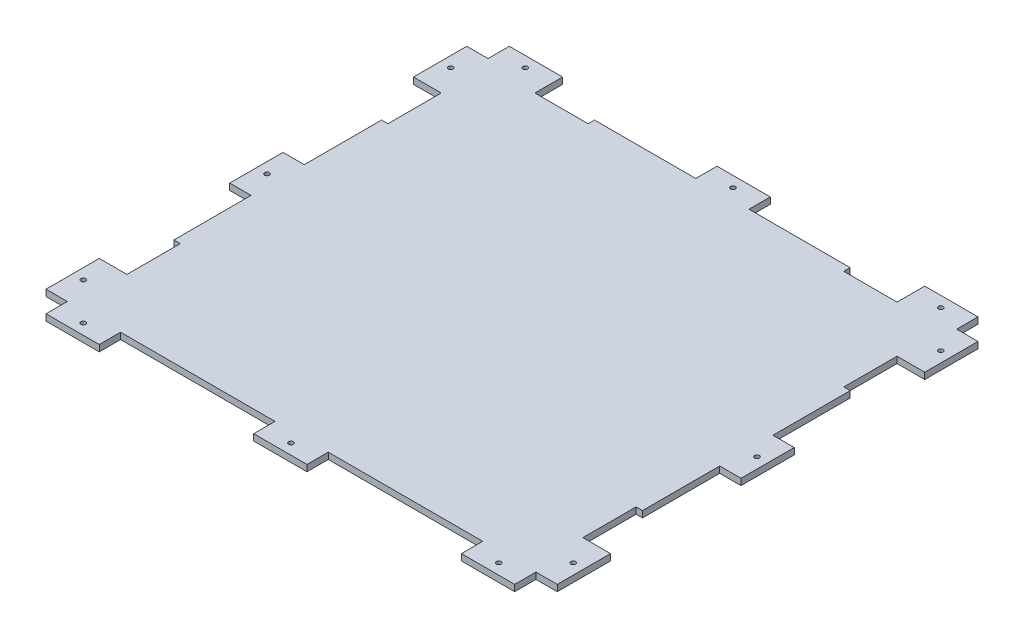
ISO-10303-21;
HEADER;
FILE_DESCRIPTION(('STEP AP214'),'2;1');
FILE_NAME('part.step','',(''),(''),'','','');
FILE_SCHEMA(('AUTOMOTIVE_DESIGN { 1 0 10303 214 1 1 1 1 }'));
ENDSEC;
DATA;
#1=APPLICATION_CONTEXT('core data for automotive mechanical design processes');
#2=APPLICATION_PROTOCOL_DEFINITION('international standard','automotive_design',2000,#1);
#3=PRODUCT_CONTEXT('',#1,'mechanical');
#4=PRODUCT('Part','Part','',(#3));
#5=PRODUCT_RELATED_PRODUCT_CATEGORY('part','',(#4));
#6=PRODUCT_DEFINITION_FORMATION('','',#4);
#7=PRODUCT_DEFINITION_CONTEXT('part definition',#1,'design');
#8=PRODUCT_DEFINITION('design','',#6,#7);
#9=PRODUCT_DEFINITION_SHAPE('','',#8);
#10=(LENGTH_UNIT() NAMED_UNIT(*) SI_UNIT(.MILLI.,.METRE.));
#11=(NAMED_UNIT(*) PLANE_ANGLE_UNIT() SI_UNIT($,.RADIAN.));
#12=(NAMED_UNIT(*) SI_UNIT($,.STERADIAN.) SOLID_ANGLE_UNIT());
#13=UNCERTAINTY_MEASURE_WITH_UNIT(LENGTH_MEASURE(1.E-05),#10,'distance_accuracy_value','');
#14=(GEOMETRIC_REPRESENTATION_CONTEXT(3) GLOBAL_UNCERTAINTY_ASSIGNED_CONTEXT((#13)) GLOBAL_UNIT_ASSIGNED_CONTEXT((#10,
#11,#12)) REPRESENTATION_CONTEXT('',''));
#15=CARTESIAN_POINT('',(0.,0.,0.));
#16=DIRECTION('',(0.,0.,1.));
#17=DIRECTION('',(1.,0.,0.));
#18=AXIS2_PLACEMENT_3D('',#15,#16,#17);
#19=CARTESIAN_POINT('',(-240.,6.,-197.5));
#20=DIRECTION('',(0.,0.,-1.));
#21=DIRECTION('',(-1.,0.,0.));
#22=AXIS2_PLACEMENT_3D('',#19,#20,#21);
#23=PLANE('',#22);
#24=DIRECTION('',(1.,0.,0.));
#25=VECTOR('',#24,1.);
#26=CARTESIAN_POINT('',(-240.,0.,-197.5));
#27=LINE('',#26,#25);
#28=CARTESIAN_POINT('',(-240.,0.,-197.5));
#29=VERTEX_POINT('',#28);
#30=CARTESIAN_POINT('',(-220.,0.,-197.5));
#31=VERTEX_POINT('',#30);
#32=EDGE_CURVE('E419',#29,#31,#27,.T.);
#33=ORIENTED_EDGE('',*,*,#32,.F.);
#34=DIRECTION('',(0.,-1.,0.));
#35=VECTOR('',#34,1.);
#36=CARTESIAN_POINT('',(-240.,6.,-197.5));
#37=LINE('',#36,#35);
#38=CARTESIAN_POINT('',(-240.,6.,-197.5));
#39=VERTEX_POINT('',#38);
#40=EDGE_CURVE('E11',#39,#29,#37,.T.);
#41=ORIENTED_EDGE('',*,*,#40,.F.);
#42=DIRECTION('',(1.,0.,0.));
#43=VECTOR('',#42,1.);
#44=CARTESIAN_POINT('',(-240.,6.,-197.5));
#45=LINE('',#44,#43);
#46=CARTESIAN_POINT('',(-220.,6.,-197.5));
#47=VERTEX_POINT('',#46);
#48=EDGE_CURVE('E570',#39,#47,#45,.T.);
#49=ORIENTED_EDGE('',*,*,#48,.T.);
#50=DIRECTION('',(0.,-1.,0.));
#51=VECTOR('',#50,1.);
#52=CARTESIAN_POINT('',(-220.,6.,-197.5));
#53=LINE('',#52,#51);
#54=EDGE_CURVE('E36',#47,#31,#53,.T.);
#55=ORIENTED_EDGE('',*,*,#54,.T.);
#56=EDGE_LOOP('',(#33,#41,#49,#55));
#57=FACE_BOUND('',#56,.T.);
#58=ADVANCED_FACE('F33',(#57),#23,.T.);
#59=CARTESIAN_POINT('',(-240.,6.,-197.5));
#60=DIRECTION('',(1.,0.,0.));
#61=DIRECTION('',(0.,0.,-1.));
#62=AXIS2_PLACEMENT_3D('',#59,#60,#61);
#63=PLANE('',#62);
#64=DIRECTION('',(0.,0.,1.));
#65=VECTOR('',#64,1.);
#66=CARTESIAN_POINT('',(-240.,0.,-197.5));
#67=LINE('',#66,#65);
#68=CARTESIAN_POINT('',(-240.,0.,-147.5));
#69=VERTEX_POINT('',#68);
#70=EDGE_CURVE('E222',#29,#69,#67,.T.);
#71=ORIENTED_EDGE('',*,*,#70,.T.);
#72=DIRECTION('',(0.,-1.,0.));
#73=VECTOR('',#72,1.);
#74=CARTESIAN_POINT('',(-240.,6.,-147.5));
#75=LINE('',#74,#73);
#76=CARTESIAN_POINT('',(-240.,6.,-147.5));
#77=VERTEX_POINT('',#76);
#78=EDGE_CURVE('E42',#77,#69,#75,.T.);
#79=ORIENTED_EDGE('',*,*,#78,.F.);
#80=DIRECTION('',(0.,0.,1.));
#81=VECTOR('',#80,1.);
#82=CARTESIAN_POINT('',(-240.,6.,-197.5));
#83=LINE('',#82,#81);
#84=EDGE_CURVE('E397',#39,#77,#83,.T.);
#85=ORIENTED_EDGE('',*,*,#84,.F.);
#86=ORIENTED_EDGE('',*,*,#40,.T.);
#87=EDGE_LOOP('',(#71,#79,#85,#86));
#88=FACE_BOUND('',#87,.T.);
#89=ADVANCED_FACE('F960',(#88),#63,.F.);
#90=CARTESIAN_POINT('',(-240.,6.,-147.5));
#91=DIRECTION('',(0.,0.,-1.));
#92=DIRECTION('',(-1.,0.,0.));
#93=AXIS2_PLACEMENT_3D('',#90,#91,#92);
#94=PLANE('',#93);
#95=DIRECTION('',(1.,0.,0.));
#96=VECTOR('',#95,1.);
#97=CARTESIAN_POINT('',(-240.,0.,-147.5));
#98=LINE('',#97,#96);
#99=CARTESIAN_POINT('',(-214.,0.,-147.5));
#100=VERTEX_POINT('',#99);
#101=EDGE_CURVE('E404',#69,#100,#98,.T.);
#102=ORIENTED_EDGE('',*,*,#101,.T.);
#103=DIRECTION('',(0.,-1.,0.));
#104=VECTOR('',#103,1.);
#105=CARTESIAN_POINT('',(-214.,6.,-147.5));
#106=LINE('',#105,#104);
#107=CARTESIAN_POINT('',(-214.,6.,-147.5));
#108=VERTEX_POINT('',#107);
#109=EDGE_CURVE('E401',#108,#100,#106,.T.);
#110=ORIENTED_EDGE('',*,*,#109,.F.);
#111=DIRECTION('',(1.,0.,0.));
#112=VECTOR('',#111,1.);
#113=CARTESIAN_POINT('',(-220.,6.,-147.5));
#114=LINE('',#113,#112);
#115=EDGE_CURVE('E391',#77,#108,#114,.T.);
#116=ORIENTED_EDGE('',*,*,#115,.F.);
#117=ORIENTED_EDGE('',*,*,#78,.T.);
#118=EDGE_LOOP('',(#102,#110,#116,#117));
#119=FACE_BOUND('',#118,.T.);
#120=ADVANCED_FACE('F402',(#119),#94,.F.);
#121=CARTESIAN_POINT('',(-214.,6.,-147.5));
#122=DIRECTION('',(1.,0.,0.));
#123=DIRECTION('',(0.,0.,-1.));
#124=AXIS2_PLACEMENT_3D('',#121,#122,#123);
#125=PLANE('',#124);
#126=DIRECTION('',(0.,0.,1.));
#127=VECTOR('',#126,1.);
#128=CARTESIAN_POINT('',(-214.,0.,-147.5));
#129=LINE('',#128,#127);
#130=CARTESIAN_POINT('',(-214.,0.,-97.5));
#131=VERTEX_POINT('',#130);
#132=EDGE_CURVE('E567',#100,#131,#129,.T.);
#133=ORIENTED_EDGE('',*,*,#132,.T.);
#134=DIRECTION('',(0.,-1.,0.));
#135=VECTOR('',#134,1.);
#136=CARTESIAN_POINT('',(-214.,6.,-97.5));
#137=LINE('',#136,#135);
#138=CARTESIAN_POINT('',(-214.,6.,-97.5));
#139=VERTEX_POINT('',#138);
#140=EDGE_CURVE('E407',#139,#131,#137,.T.);
#141=ORIENTED_EDGE('',*,*,#140,.F.);
#142=DIRECTION('',(0.,0.,1.));
#143=VECTOR('',#142,1.);
#144=CARTESIAN_POINT('',(-214.,6.,-147.5));
#145=LINE('',#144,#143);
#146=EDGE_CURVE('E395',#108,#139,#145,.T.);
#147=ORIENTED_EDGE('',*,*,#146,.F.);
#148=ORIENTED_EDGE('',*,*,#109,.T.);
#149=EDGE_LOOP('',(#133,#141,#147,#148));
#150=FACE_BOUND('',#149,.T.);
#151=ADVANCED_FACE('F409',(#150),#125,.F.);
#152=CARTESIAN_POINT('',(-214.,6.,-97.5));
#153=DIRECTION('',(0.,0.,1.));
#154=DIRECTION('',(1.,0.,0.));
#155=AXIS2_PLACEMENT_3D('',#152,#153,#154);
#156=PLANE('',#155);
#157=DIRECTION('',(-1.,0.,0.));
#158=VECTOR('',#157,1.);
#159=CARTESIAN_POINT('',(-214.,0.,-97.5));
#160=LINE('',#159,#158);
#161=CARTESIAN_POINT('',(-220.,0.,-97.5));
#162=VERTEX_POINT('',#161);
#163=EDGE_CURVE('E565',#131,#162,#160,.T.);
#164=ORIENTED_EDGE('',*,*,#163,.T.);
#165=DIRECTION('',(0.,-1.,0.));
#166=VECTOR('',#165,1.);
#167=CARTESIAN_POINT('',(-220.,6.,-97.5));
#168=LINE('',#167,#166);
#169=CARTESIAN_POINT('',(-220.,6.,-97.5));
#170=VERTEX_POINT('',#169);
#171=EDGE_CURVE('E574',#170,#162,#168,.T.);
#172=ORIENTED_EDGE('',*,*,#171,.F.);
#173=DIRECTION('',(-1.,0.,0.));
#174=VECTOR('',#173,1.);
#175=CARTESIAN_POINT('',(-214.,6.,-97.5));
#176=LINE('',#175,#174);
#177=EDGE_CURVE('E412',#139,#170,#176,.T.);
#178=ORIENTED_EDGE('',*,*,#177,.F.);
#179=ORIENTED_EDGE('',*,*,#140,.T.);
#180=EDGE_LOOP('',(#164,#172,#178,#179));
#181=FACE_BOUND('',#180,.T.);
#182=ADVANCED_FACE('F699',(#181),#156,.F.);
#183=CARTESIAN_POINT('',(-220.,6.,-97.5));
#184=DIRECTION('',(1.,0.,0.));
#185=DIRECTION('',(0.,0.,-1.));
#186=AXIS2_PLACEMENT_3D('',#183,#184,#185);
#187=PLANE('',#186);
#188=DIRECTION('',(0.,0.,1.));
#189=VECTOR('',#188,1.);
#190=CARTESIAN_POINT('',(-220.,0.,-97.5));
#191=LINE('',#190,#189);
#192=CARTESIAN_POINT('',(-220.,0.,-25.));
#193=VERTEX_POINT('',#192);
#194=EDGE_CURVE('E562',#162,#193,#191,.T.);
#195=ORIENTED_EDGE('',*,*,#194,.T.);
#196=DIRECTION('',(0.,-1.,0.));
#197=VECTOR('',#196,1.);
#198=CARTESIAN_POINT('',(-220.,6.,-25.));
#199=LINE('',#198,#197);
#200=CARTESIAN_POINT('',(-220.,6.,-25.));
#201=VERTEX_POINT('',#200);
#202=EDGE_CURVE('E577',#201,#193,#199,.T.);
#203=ORIENTED_EDGE('',*,*,#202,.F.);
#204=DIRECTION('',(0.,0.,1.));
#205=VECTOR('',#204,1.);
#206=CARTESIAN_POINT('',(-220.,6.,-97.5));
#207=LINE('',#206,#205);
#208=EDGE_CURVE('E414',#170,#201,#207,.T.);
#209=ORIENTED_EDGE('',*,*,#208,.F.);
#210=ORIENTED_EDGE('',*,*,#171,.T.);
#211=EDGE_LOOP('',(#195,#203,#209,#210));
#212=FACE_BOUND('',#211,.T.);
#213=ADVANCED_FACE('F707',(#212),#187,.F.);
#214=CARTESIAN_POINT('',(-240.,6.,-25.));
#215=DIRECTION('',(0.,0.,-1.));
#216=DIRECTION('',(-1.,0.,0.));
#217=AXIS2_PLACEMENT_3D('',#214,#215,#216);
#218=PLANE('',#217);
#219=DIRECTION('',(1.,0.,0.));
#220=VECTOR('',#219,1.);
#221=CARTESIAN_POINT('',(-240.,0.,-25.));
#222=LINE('',#221,#220);
#223=CARTESIAN_POINT('',(-240.,0.,-25.));
#224=VERTEX_POINT('',#223);
#225=EDGE_CURVE('E559',#224,#193,#222,.T.);
#226=ORIENTED_EDGE('',*,*,#225,.F.);
#227=DIRECTION('',(0.,-1.,0.));
#228=VECTOR('',#227,1.);
#229=CARTESIAN_POINT('',(-240.,6.,-25.));
#230=LINE('',#229,#228);
#231=CARTESIAN_POINT('',(-240.,6.,-25.));
#232=VERTEX_POINT('',#231);
#233=EDGE_CURVE('E579',#232,#224,#230,.T.);
#234=ORIENTED_EDGE('',*,*,#233,.F.);
#235=DIRECTION('',(1.,0.,0.));
#236=VECTOR('',#235,1.);
#237=CARTESIAN_POINT('',(-240.,6.,-25.));
#238=LINE('',#237,#236);
#239=EDGE_CURVE('E705',#232,#201,#238,.T.);
#240=ORIENTED_EDGE('',*,*,#239,.T.);
#241=ORIENTED_EDGE('',*,*,#202,.T.);
#242=EDGE_LOOP('',(#226,#234,#240,#241));
#243=FACE_BOUND('',#242,.T.);
#244=ADVANCED_FACE('F710',(#243),#218,.T.);
#245=CARTESIAN_POINT('',(-240.,6.,-25.));
#246=DIRECTION('',(1.,0.,0.));
#247=DIRECTION('',(0.,0.,-1.));
#248=AXIS2_PLACEMENT_3D('',#245,#246,#247);
#249=PLANE('',#248);
#250=DIRECTION('',(0.,0.,1.));
#251=VECTOR('',#250,1.);
#252=CARTESIAN_POINT('',(-240.,0.,-25.));
#253=LINE('',#252,#251);
#254=CARTESIAN_POINT('',(-240.,0.,25.));
#255=VERTEX_POINT('',#254);
#256=EDGE_CURVE('E557',#224,#255,#253,.T.);
#257=ORIENTED_EDGE('',*,*,#256,.T.);
#258=DIRECTION('',(0.,-1.,0.));
#259=VECTOR('',#258,1.);
#260=CARTESIAN_POINT('',(-240.,6.,25.));
#261=LINE('',#260,#259);
#262=CARTESIAN_POINT('',(-240.,6.,25.));
#263=VERTEX_POINT('',#262);
#264=EDGE_CURVE('E581',#263,#255,#261,.T.);
#265=ORIENTED_EDGE('',*,*,#264,.F.);
#266=DIRECTION('',(0.,0.,1.));
#267=VECTOR('',#266,1.);
#268=CARTESIAN_POINT('',(-240.,6.,-25.));
#269=LINE('',#268,#267);
#270=EDGE_CURVE('E712',#232,#263,#269,.T.);
#271=ORIENTED_EDGE('',*,*,#270,.F.);
#272=ORIENTED_EDGE('',*,*,#233,.T.);
#273=EDGE_LOOP('',(#257,#265,#271,#272));
#274=FACE_BOUND('',#273,.T.);
#275=ADVANCED_FACE('F978',(#274),#249,.F.);
#276=CARTESIAN_POINT('',(-240.,6.,25.));
#277=DIRECTION('',(0.,0.,-1.));
#278=DIRECTION('',(-1.,0.,0.));
#279=AXIS2_PLACEMENT_3D('',#276,#277,#278);
#280=PLANE('',#279);
#281=DIRECTION('',(1.,0.,0.));
#282=VECTOR('',#281,1.);
#283=CARTESIAN_POINT('',(-240.,0.,25.));
#284=LINE('',#283,#282);
#285=CARTESIAN_POINT('',(-220.,0.,25.));
#286=VERTEX_POINT('',#285);
#287=EDGE_CURVE('E554',#255,#286,#284,.T.);
#288=ORIENTED_EDGE('',*,*,#287,.T.);
#289=DIRECTION('',(0.,-1.,0.));
#290=VECTOR('',#289,1.);
#291=CARTESIAN_POINT('',(-220.,6.,25.));
#292=LINE('',#291,#290);
#293=CARTESIAN_POINT('',(-220.,6.,25.));
#294=VERTEX_POINT('',#293);
#295=EDGE_CURVE('E584',#294,#286,#292,.T.);
#296=ORIENTED_EDGE('',*,*,#295,.F.);
#297=DIRECTION('',(1.,0.,0.));
#298=VECTOR('',#297,1.);
#299=CARTESIAN_POINT('',(-240.,6.,25.));
#300=LINE('',#299,#298);
#301=EDGE_CURVE('E714',#263,#294,#300,.T.);
#302=ORIENTED_EDGE('',*,*,#301,.F.);
#303=ORIENTED_EDGE('',*,*,#264,.T.);
#304=EDGE_LOOP('',(#288,#296,#302,#303));
#305=FACE_BOUND('',#304,.T.);
#306=ADVANCED_FACE('F981',(#305),#280,.F.);
#307=CARTESIAN_POINT('',(-220.,6.,97.5));
#308=DIRECTION('',(-1.,0.,0.));
#309=DIRECTION('',(0.,0.,1.));
#310=AXIS2_PLACEMENT_3D('',#307,#308,#309);
#311=PLANE('',#310);
#312=DIRECTION('',(0.,0.,-1.));
#313=VECTOR('',#312,1.);
#314=CARTESIAN_POINT('',(-220.,0.,97.5));
#315=LINE('',#314,#313);
#316=CARTESIAN_POINT('',(-220.,0.,97.5));
#317=VERTEX_POINT('',#316);
#318=EDGE_CURVE('E551',#317,#286,#315,.T.);
#319=ORIENTED_EDGE('',*,*,#318,.F.);
#320=DIRECTION('',(0.,-1.,0.));
#321=VECTOR('',#320,1.);
#322=CARTESIAN_POINT('',(-220.,6.,97.5));
#323=LINE('',#322,#321);
#324=CARTESIAN_POINT('',(-220.,6.,97.5));
#325=VERTEX_POINT('',#324);
#326=EDGE_CURVE('E586',#325,#317,#323,.T.);
#327=ORIENTED_EDGE('',*,*,#326,.F.);
#328=DIRECTION('',(0.,0.,-1.));
#329=VECTOR('',#328,1.);
#330=CARTESIAN_POINT('',(-220.,6.,97.5));
#331=LINE('',#330,#329);
#332=EDGE_CURVE('E718',#325,#294,#331,.T.);
#333=ORIENTED_EDGE('',*,*,#332,.T.);
#334=ORIENTED_EDGE('',*,*,#295,.T.);
#335=EDGE_LOOP('',(#319,#327,#333,#334));
#336=FACE_BOUND('',#335,.T.);
#337=ADVANCED_FACE('F985',(#336),#311,.T.);
#338=CARTESIAN_POINT('',(-214.,6.,97.5000000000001));
#339=DIRECTION('',(0.,0.,1.));
#340=DIRECTION('',(1.,0.,0.));
#341=AXIS2_PLACEMENT_3D('',#338,#339,#340);
#342=PLANE('',#341);
#343=DIRECTION('',(-1.,0.,0.));
#344=VECTOR('',#343,1.);
#345=CARTESIAN_POINT('',(-214.,0.,97.5000000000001));
#346=LINE('',#345,#344);
#347=CARTESIAN_POINT('',(-214.,0.,97.5000000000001));
#348=VERTEX_POINT('',#347);
#349=EDGE_CURVE('E548',#348,#317,#346,.T.);
#350=ORIENTED_EDGE('',*,*,#349,.F.);
#351=DIRECTION('',(0.,-1.,0.));
#352=VECTOR('',#351,1.);
#353=CARTESIAN_POINT('',(-214.,6.,97.5000000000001));
#354=LINE('',#353,#352);
#355=CARTESIAN_POINT('',(-214.,6.,97.5000000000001));
#356=VERTEX_POINT('',#355);
#357=EDGE_CURVE('E588',#356,#348,#354,.T.);
#358=ORIENTED_EDGE('',*,*,#357,.F.);
#359=DIRECTION('',(-1.,0.,0.));
#360=VECTOR('',#359,1.);
#361=CARTESIAN_POINT('',(-214.,6.,97.5000000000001));
#362=LINE('',#361,#360);
#363=EDGE_CURVE('E721',#356,#325,#362,.T.);
#364=ORIENTED_EDGE('',*,*,#363,.T.);
#365=ORIENTED_EDGE('',*,*,#326,.T.);
#366=EDGE_LOOP('',(#350,#358,#364,#365));
#367=FACE_BOUND('',#366,.T.);
#368=ADVANCED_FACE('F989',(#367),#342,.T.);
#369=CARTESIAN_POINT('',(-214.,6.,147.5));
#370=DIRECTION('',(-1.,0.,0.));
#371=DIRECTION('',(0.,0.,1.));
#372=AXIS2_PLACEMENT_3D('',#369,#370,#371);
#373=PLANE('',#372);
#374=DIRECTION('',(0.,0.,-1.));
#375=VECTOR('',#374,1.);
#376=CARTESIAN_POINT('',(-214.,0.,147.5));
#377=LINE('',#376,#375);
#378=CARTESIAN_POINT('',(-214.,0.,147.5));
#379=VERTEX_POINT('',#378);
#380=EDGE_CURVE('E545',#379,#348,#377,.T.);
#381=ORIENTED_EDGE('',*,*,#380,.F.);
#382=DIRECTION('',(0.,-1.,0.));
#383=VECTOR('',#382,1.);
#384=CARTESIAN_POINT('',(-214.,6.,147.5));
#385=LINE('',#384,#383);
#386=CARTESIAN_POINT('',(-214.,6.,147.5));
#387=VERTEX_POINT('',#386);
#388=EDGE_CURVE('E590',#387,#379,#385,.T.);
#389=ORIENTED_EDGE('',*,*,#388,.F.);
#390=DIRECTION('',(0.,0.,-1.));
#391=VECTOR('',#390,1.);
#392=CARTESIAN_POINT('',(-214.,6.,147.5));
#393=LINE('',#392,#391);
#394=EDGE_CURVE('E724',#387,#356,#393,.T.);
#395=ORIENTED_EDGE('',*,*,#394,.T.);
#396=ORIENTED_EDGE('',*,*,#357,.T.);
#397=EDGE_LOOP('',(#381,#389,#395,#396));
#398=FACE_BOUND('',#397,.T.);
#399=ADVANCED_FACE('F993',(#398),#373,.T.);
#400=CARTESIAN_POINT('',(-220.,6.,147.5));
#401=DIRECTION('',(0.,0.,-1.));
#402=DIRECTION('',(-1.,0.,0.));
#403=AXIS2_PLACEMENT_3D('',#400,#401,#402);
#404=PLANE('',#403);
#405=DIRECTION('',(1.,0.,0.));
#406=VECTOR('',#405,1.);
#407=CARTESIAN_POINT('',(-220.,0.,147.5));
#408=LINE('',#407,#406);
#409=CARTESIAN_POINT('',(-240.,0.,147.5));
#410=VERTEX_POINT('',#409);
#411=EDGE_CURVE('E542',#410,#379,#408,.T.);
#412=ORIENTED_EDGE('',*,*,#411,.F.);
#413=DIRECTION('',(0.,-1.,0.));
#414=VECTOR('',#413,1.);
#415=CARTESIAN_POINT('',(-240.,6.,147.5));
#416=LINE('',#415,#414);
#417=CARTESIAN_POINT('',(-240.,6.,147.5));
#418=VERTEX_POINT('',#417);
#419=EDGE_CURVE('E592',#418,#410,#416,.T.);
#420=ORIENTED_EDGE('',*,*,#419,.F.);
#421=DIRECTION('',(1.,0.,0.));
#422=VECTOR('',#421,1.);
#423=CARTESIAN_POINT('',(-240.,6.,147.5));
#424=LINE('',#423,#422);
#425=EDGE_CURVE('E727',#418,#387,#424,.T.);
#426=ORIENTED_EDGE('',*,*,#425,.T.);
#427=ORIENTED_EDGE('',*,*,#388,.T.);
#428=EDGE_LOOP('',(#412,#420,#426,#427));
#429=FACE_BOUND('',#428,.T.);
#430=ADVANCED_FACE('F997',(#429),#404,.T.);
#431=CARTESIAN_POINT('',(-240.,6.,197.5));
#432=DIRECTION('',(-1.,0.,0.));
#433=DIRECTION('',(0.,0.,1.));
#434=AXIS2_PLACEMENT_3D('',#431,#432,#433);
#435=PLANE('',#434);
#436=DIRECTION('',(0.,0.,-1.));
#437=VECTOR('',#436,1.);
#438=CARTESIAN_POINT('',(-240.,0.,197.5));
#439=LINE('',#438,#437);
#440=CARTESIAN_POINT('',(-240.,0.,197.5));
#441=VERTEX_POINT('',#440);
#442=EDGE_CURVE('E539',#441,#410,#439,.T.);
#443=ORIENTED_EDGE('',*,*,#442,.F.);
#444=DIRECTION('',(0.,-1.,0.));
#445=VECTOR('',#444,1.);
#446=CARTESIAN_POINT('',(-240.,6.,197.5));
#447=LINE('',#446,#445);
#448=CARTESIAN_POINT('',(-240.,6.,197.5));
#449=VERTEX_POINT('',#448);
#450=EDGE_CURVE('E595',#449,#441,#447,.T.);
#451=ORIENTED_EDGE('',*,*,#450,.F.);
#452=DIRECTION('',(0.,0.,-1.));
#453=VECTOR('',#452,1.);
#454=CARTESIAN_POINT('',(-240.,6.,197.5));
#455=LINE('',#454,#453);
#456=EDGE_CURVE('E729',#449,#418,#455,.T.);
#457=ORIENTED_EDGE('',*,*,#456,.T.);
#458=ORIENTED_EDGE('',*,*,#419,.T.);
#459=EDGE_LOOP('',(#443,#451,#457,#458));
#460=FACE_BOUND('',#459,.T.);
#461=ADVANCED_FACE('F1001',(#460),#435,.T.);
#462=CARTESIAN_POINT('',(-240.,6.,197.5));
#463=DIRECTION('',(0.,0.,-1.));
#464=DIRECTION('',(-1.,0.,0.));
#465=AXIS2_PLACEMENT_3D('',#462,#463,#464);
#466=PLANE('',#465);
#467=DIRECTION('',(1.,0.,0.));
#468=VECTOR('',#467,1.);
#469=CARTESIAN_POINT('',(-240.,0.,197.5));
#470=LINE('',#469,#468);
#471=CARTESIAN_POINT('',(-220.,0.,197.5));
#472=VERTEX_POINT('',#471);
#473=EDGE_CURVE('E536',#441,#472,#470,.T.);
#474=ORIENTED_EDGE('',*,*,#473,.T.);
#475=DIRECTION('',(0.,-1.,0.));
#476=VECTOR('',#475,1.);
#477=CARTESIAN_POINT('',(-220.,6.,197.5));
#478=LINE('',#477,#476);
#479=CARTESIAN_POINT('',(-220.,6.,197.5));
#480=VERTEX_POINT('',#479);
#481=EDGE_CURVE('E597',#480,#472,#478,.T.);
#482=ORIENTED_EDGE('',*,*,#481,.F.);
#483=DIRECTION('',(1.,0.,0.));
#484=VECTOR('',#483,1.);
#485=CARTESIAN_POINT('',(-240.,6.,197.5));
#486=LINE('',#485,#484);
#487=EDGE_CURVE('E732',#449,#480,#486,.T.);
#488=ORIENTED_EDGE('',*,*,#487,.F.);
#489=ORIENTED_EDGE('',*,*,#450,.T.);
#490=EDGE_LOOP('',(#474,#482,#488,#489));
#491=FACE_BOUND('',#490,.T.);
#492=ADVANCED_FACE('F1005',(#491),#466,.F.);
#493=CARTESIAN_POINT('',(-220.,6.,217.5));
#494=DIRECTION('',(-1.,0.,0.));
#495=DIRECTION('',(0.,0.,1.));
#496=AXIS2_PLACEMENT_3D('',#493,#494,#495);
#497=PLANE('',#496);
#498=DIRECTION('',(0.,0.,-1.));
#499=VECTOR('',#498,1.);
#500=CARTESIAN_POINT('',(-220.,0.,217.5));
#501=LINE('',#500,#499);
#502=CARTESIAN_POINT('',(-220.,0.,217.5));
#503=VERTEX_POINT('',#502);
#504=EDGE_CURVE('E533',#503,#472,#501,.T.);
#505=ORIENTED_EDGE('',*,*,#504,.F.);
#506=DIRECTION('',(0.,-1.,0.));
#507=VECTOR('',#506,1.);
#508=CARTESIAN_POINT('',(-220.,6.,217.5));
#509=LINE('',#508,#507);
#510=CARTESIAN_POINT('',(-220.,6.,217.5));
#511=VERTEX_POINT('',#510);
#512=EDGE_CURVE('E599',#511,#503,#509,.T.);
#513=ORIENTED_EDGE('',*,*,#512,.F.);
#514=DIRECTION('',(0.,0.,-1.));
#515=VECTOR('',#514,1.);
#516=CARTESIAN_POINT('',(-220.,6.,217.5));
#517=LINE('',#516,#515);
#518=EDGE_CURVE('E734',#511,#480,#517,.T.);
#519=ORIENTED_EDGE('',*,*,#518,.T.);
#520=ORIENTED_EDGE('',*,*,#481,.T.);
#521=EDGE_LOOP('',(#505,#513,#519,#520));
#522=FACE_BOUND('',#521,.T.);
#523=ADVANCED_FACE('F1009',(#522),#497,.T.);
#524=CARTESIAN_POINT('',(-220.,6.,217.5));
#525=DIRECTION('',(0.,0.,-1.));
#526=DIRECTION('',(-1.,0.,0.));
#527=AXIS2_PLACEMENT_3D('',#524,#525,#526);
#528=PLANE('',#527);
#529=DIRECTION('',(1.,0.,0.));
#530=VECTOR('',#529,1.);
#531=CARTESIAN_POINT('',(-220.,0.,217.5));
#532=LINE('',#531,#530);
#533=CARTESIAN_POINT('',(-170.,0.,217.5));
#534=VERTEX_POINT('',#533);
#535=EDGE_CURVE('E531',#503,#534,#532,.T.);
#536=ORIENTED_EDGE('',*,*,#535,.T.);
#537=DIRECTION('',(0.,-1.,0.));
#538=VECTOR('',#537,1.);
#539=CARTESIAN_POINT('',(-170.,6.,217.5));
#540=LINE('',#539,#538);
#541=CARTESIAN_POINT('',(-170.,6.,217.5));
#542=VERTEX_POINT('',#541);
#543=EDGE_CURVE('E601',#542,#534,#540,.T.);
#544=ORIENTED_EDGE('',*,*,#543,.F.);
#545=DIRECTION('',(1.,0.,0.));
#546=VECTOR('',#545,1.);
#547=CARTESIAN_POINT('',(-220.,6.,217.5));
#548=LINE('',#547,#546);
#549=EDGE_CURVE('E737',#511,#542,#548,.T.);
#550=ORIENTED_EDGE('',*,*,#549,.F.);
#551=ORIENTED_EDGE('',*,*,#512,.T.);
#552=EDGE_LOOP('',(#536,#544,#550,#551));
#553=FACE_BOUND('',#552,.T.);
#554=ADVANCED_FACE('F1013',(#553),#528,.F.);
#555=CARTESIAN_POINT('',(-170.,6.,217.5));
#556=DIRECTION('',(-1.,0.,0.));
#557=DIRECTION('',(0.,0.,1.));
#558=AXIS2_PLACEMENT_3D('',#555,#556,#557);
#559=PLANE('',#558);
#560=DIRECTION('',(0.,0.,-1.));
#561=VECTOR('',#560,1.);
#562=CARTESIAN_POINT('',(-170.,0.,217.5));
#563=LINE('',#562,#561);
#564=CARTESIAN_POINT('',(-170.,0.,197.5));
#565=VERTEX_POINT('',#564);
#566=EDGE_CURVE('E529',#534,#565,#563,.T.);
#567=ORIENTED_EDGE('',*,*,#566,.T.);
#568=DIRECTION('',(0.,-1.,0.));
#569=VECTOR('',#568,1.);
#570=CARTESIAN_POINT('',(-170.,6.,197.5));
#571=LINE('',#570,#569);
#572=CARTESIAN_POINT('',(-170.,6.,197.5));
#573=VERTEX_POINT('',#572);
#574=EDGE_CURVE('E604',#573,#565,#571,.T.);
#575=ORIENTED_EDGE('',*,*,#574,.F.);
#576=DIRECTION('',(0.,0.,-1.));
#577=VECTOR('',#576,1.);
#578=CARTESIAN_POINT('',(-170.,6.,217.5));
#579=LINE('',#578,#577);
#580=EDGE_CURVE('E739',#542,#573,#579,.T.);
#581=ORIENTED_EDGE('',*,*,#580,.F.);
#582=ORIENTED_EDGE('',*,*,#543,.T.);
#583=EDGE_LOOP('',(#567,#575,#581,#582));
#584=FACE_BOUND('',#583,.T.);
#585=ADVANCED_FACE('F1017',(#584),#559,.F.);
#586=CARTESIAN_POINT('',(-170.,6.,197.5));
#587=DIRECTION('',(0.,0.,-1.));
#588=DIRECTION('',(-1.,0.,0.));
#589=AXIS2_PLACEMENT_3D('',#586,#587,#588);
#590=PLANE('',#589);
#591=DIRECTION('',(1.,0.,0.));
#592=VECTOR('',#591,1.);
#593=CARTESIAN_POINT('',(-170.,0.,197.5));
#594=LINE('',#593,#592);
#595=CARTESIAN_POINT('',(-25.,0.,197.5));
#596=VERTEX_POINT('',#595);
#597=EDGE_CURVE('E527',#565,#596,#594,.T.);
#598=ORIENTED_EDGE('',*,*,#597,.T.);
#599=DIRECTION('',(0.,-1.,0.));
#600=VECTOR('',#599,1.);
#601=CARTESIAN_POINT('',(-25.,6.,197.5));
#602=LINE('',#601,#600);
#603=CARTESIAN_POINT('',(-25.,6.,197.5));
#604=VERTEX_POINT('',#603);
#605=EDGE_CURVE('E607',#604,#596,#602,.T.);
#606=ORIENTED_EDGE('',*,*,#605,.F.);
#607=DIRECTION('',(1.,0.,0.));
#608=VECTOR('',#607,1.);
#609=CARTESIAN_POINT('',(-120.,6.,197.5));
#610=LINE('',#609,#608);
#611=EDGE_CURVE('E742',#573,#604,#610,.T.);
#612=ORIENTED_EDGE('',*,*,#611,.F.);
#613=ORIENTED_EDGE('',*,*,#574,.T.);
#614=EDGE_LOOP('',(#598,#606,#612,#613));
#615=FACE_BOUND('',#614,.T.);
#616=ADVANCED_FACE('F1021',(#615),#590,.F.);
#617=CARTESIAN_POINT('',(-25.,6.,217.5));
#618=DIRECTION('',(-1.,0.,0.));
#619=DIRECTION('',(0.,0.,1.));
#620=AXIS2_PLACEMENT_3D('',#617,#618,#619);
#621=PLANE('',#620);
#622=DIRECTION('',(0.,0.,-1.));
#623=VECTOR('',#622,1.);
#624=CARTESIAN_POINT('',(-25.,0.,217.5));
#625=LINE('',#624,#623);
#626=CARTESIAN_POINT('',(-25.,0.,217.5));
#627=VERTEX_POINT('',#626);
#628=EDGE_CURVE('E524',#627,#596,#625,.T.);
#629=ORIENTED_EDGE('',*,*,#628,.F.);
#630=DIRECTION('',(0.,-1.,0.));
#631=VECTOR('',#630,1.);
#632=CARTESIAN_POINT('',(-25.,6.,217.5));
#633=LINE('',#632,#631);
#634=CARTESIAN_POINT('',(-25.,6.,217.5));
#635=VERTEX_POINT('',#634);
#636=EDGE_CURVE('E610',#635,#627,#633,.T.);
#637=ORIENTED_EDGE('',*,*,#636,.F.);
#638=DIRECTION('',(0.,0.,-1.));
#639=VECTOR('',#638,1.);
#640=CARTESIAN_POINT('',(-25.,6.,217.5));
#641=LINE('',#640,#639);
#642=EDGE_CURVE('E744',#635,#604,#641,.T.);
#643=ORIENTED_EDGE('',*,*,#642,.T.);
#644=ORIENTED_EDGE('',*,*,#605,.T.);
#645=EDGE_LOOP('',(#629,#637,#643,#644));
#646=FACE_BOUND('',#645,.T.);
#647=ADVANCED_FACE('F1025',(#646),#621,.T.);
#648=CARTESIAN_POINT('',(-25.,6.,217.5));
#649=DIRECTION('',(0.,0.,-1.));
#650=DIRECTION('',(-1.,0.,0.));
#651=AXIS2_PLACEMENT_3D('',#648,#649,#650);
#652=PLANE('',#651);
#653=DIRECTION('',(1.,0.,0.));
#654=VECTOR('',#653,1.);
#655=CARTESIAN_POINT('',(-25.,0.,217.5));
#656=LINE('',#655,#654);
#657=CARTESIAN_POINT('',(25.0000000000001,0.,217.5));
#658=VERTEX_POINT('',#657);
#659=EDGE_CURVE('E522',#627,#658,#656,.T.);
#660=ORIENTED_EDGE('',*,*,#659,.T.);
#661=DIRECTION('',(0.,-1.,0.));
#662=VECTOR('',#661,1.);
#663=CARTESIAN_POINT('',(25.0000000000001,6.,217.5));
#664=LINE('',#663,#662);
#665=CARTESIAN_POINT('',(25.0000000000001,6.,217.5));
#666=VERTEX_POINT('',#665);
#667=EDGE_CURVE('E612',#666,#658,#664,.T.);
#668=ORIENTED_EDGE('',*,*,#667,.F.);
#669=DIRECTION('',(1.,0.,0.));
#670=VECTOR('',#669,1.);
#671=CARTESIAN_POINT('',(-25.,6.,217.5));
#672=LINE('',#671,#670);
#673=EDGE_CURVE('E747',#635,#666,#672,.T.);
#674=ORIENTED_EDGE('',*,*,#673,.F.);
#675=ORIENTED_EDGE('',*,*,#636,.T.);
#676=EDGE_LOOP('',(#660,#668,#674,#675));
#677=FACE_BOUND('',#676,.T.);
#678=ADVANCED_FACE('F1029',(#677),#652,.F.);
#679=CARTESIAN_POINT('',(25.0000000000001,6.,217.5));
#680=DIRECTION('',(-1.,0.,0.));
#681=DIRECTION('',(0.,0.,1.));
#682=AXIS2_PLACEMENT_3D('',#679,#680,#681);
#683=PLANE('',#682);
#684=DIRECTION('',(0.,0.,-1.));
#685=VECTOR('',#684,1.);
#686=CARTESIAN_POINT('',(25.0000000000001,0.,217.5));
#687=LINE('',#686,#685);
#688=CARTESIAN_POINT('',(25.0000000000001,0.,197.5));
#689=VERTEX_POINT('',#688);
#690=EDGE_CURVE('E519',#658,#689,#687,.T.);
#691=ORIENTED_EDGE('',*,*,#690,.T.);
#692=DIRECTION('',(0.,-1.,0.));
#693=VECTOR('',#692,1.);
#694=CARTESIAN_POINT('',(25.0000000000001,6.,197.5));
#695=LINE('',#694,#693);
#696=CARTESIAN_POINT('',(25.0000000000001,6.,197.5));
#697=VERTEX_POINT('',#696);
#698=EDGE_CURVE('E615',#697,#689,#695,.T.);
#699=ORIENTED_EDGE('',*,*,#698,.F.);
#700=DIRECTION('',(0.,0.,-1.));
#701=VECTOR('',#700,1.);
#702=CARTESIAN_POINT('',(25.0000000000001,6.,217.5));
#703=LINE('',#702,#701);
#704=EDGE_CURVE('E749',#666,#697,#703,.T.);
#705=ORIENTED_EDGE('',*,*,#704,.F.);
#706=ORIENTED_EDGE('',*,*,#667,.T.);
#707=EDGE_LOOP('',(#691,#699,#705,#706));
#708=FACE_BOUND('',#707,.T.);
#709=ADVANCED_FACE('F1033',(#708),#683,.F.);
#710=CARTESIAN_POINT('',(120.,6.,197.5));
#711=DIRECTION('',(0.,0.,1.));
#712=DIRECTION('',(1.,0.,0.));
#713=AXIS2_PLACEMENT_3D('',#710,#711,#712);
#714=PLANE('',#713);
#715=DIRECTION('',(-1.,0.,0.));
#716=VECTOR('',#715,1.);
#717=CARTESIAN_POINT('',(120.,0.,197.5));
#718=LINE('',#717,#716);
#719=CARTESIAN_POINT('',(170.,0.,197.5));
#720=VERTEX_POINT('',#719);
#721=EDGE_CURVE('E516',#720,#689,#718,.T.);
#722=ORIENTED_EDGE('',*,*,#721,.F.);
#723=DIRECTION('',(0.,-1.,0.));
#724=VECTOR('',#723,1.);
#725=CARTESIAN_POINT('',(170.,6.,197.5));
#726=LINE('',#725,#724);
#727=CARTESIAN_POINT('',(170.,6.,197.5));
#728=VERTEX_POINT('',#727);
#729=EDGE_CURVE('E617',#728,#720,#726,.T.);
#730=ORIENTED_EDGE('',*,*,#729,.F.);
#731=DIRECTION('',(1.,0.,0.));
#732=VECTOR('',#731,1.);
#733=CARTESIAN_POINT('',(120.,6.,197.5));
#734=LINE('',#733,#732);
#735=EDGE_CURVE('E752',#697,#728,#734,.T.);
#736=ORIENTED_EDGE('',*,*,#735,.F.);
#737=ORIENTED_EDGE('',*,*,#698,.T.);
#738=EDGE_LOOP('',(#722,#730,#736,#737));
#739=FACE_BOUND('',#738,.T.);
#740=ADVANCED_FACE('F1037',(#739),#714,.T.);
#741=CARTESIAN_POINT('',(170.,6.,217.5));
#742=DIRECTION('',(-1.,0.,0.));
#743=DIRECTION('',(0.,0.,1.));
#744=AXIS2_PLACEMENT_3D('',#741,#742,#743);
#745=PLANE('',#744);
#746=DIRECTION('',(0.,0.,-1.));
#747=VECTOR('',#746,1.);
#748=CARTESIAN_POINT('',(170.,0.,217.5));
#749=LINE('',#748,#747);
#750=CARTESIAN_POINT('',(170.,0.,217.5));
#751=VERTEX_POINT('',#750);
#752=EDGE_CURVE('E513',#751,#720,#749,.T.);
#753=ORIENTED_EDGE('',*,*,#752,.F.);
#754=DIRECTION('',(0.,-1.,0.));
#755=VECTOR('',#754,1.);
#756=CARTESIAN_POINT('',(170.,6.,217.5));
#757=LINE('',#756,#755);
#758=CARTESIAN_POINT('',(170.,6.,217.5));
#759=VERTEX_POINT('',#758);
#760=EDGE_CURVE('E620',#759,#751,#757,.T.);
#761=ORIENTED_EDGE('',*,*,#760,.F.);
#762=DIRECTION('',(0.,0.,-1.));
#763=VECTOR('',#762,1.);
#764=CARTESIAN_POINT('',(170.,6.,217.5));
#765=LINE('',#764,#763);
#766=EDGE_CURVE('E754',#759,#728,#765,.T.);
#767=ORIENTED_EDGE('',*,*,#766,.T.);
#768=ORIENTED_EDGE('',*,*,#729,.T.);
#769=EDGE_LOOP('',(#753,#761,#767,#768));
#770=FACE_BOUND('',#769,.T.);
#771=ADVANCED_FACE('F1041',(#770),#745,.T.);
#772=CARTESIAN_POINT('',(220.,6.,217.5));
#773=DIRECTION('',(0.,0.,1.));
#774=DIRECTION('',(1.,0.,0.));
#775=AXIS2_PLACEMENT_3D('',#772,#773,#774);
#776=PLANE('',#775);
#777=DIRECTION('',(-1.,0.,0.));
#778=VECTOR('',#777,1.);
#779=CARTESIAN_POINT('',(220.,0.,217.5));
#780=LINE('',#779,#778);
#781=CARTESIAN_POINT('',(220.,0.,217.5));
#782=VERTEX_POINT('',#781);
#783=EDGE_CURVE('E510',#782,#751,#780,.T.);
#784=ORIENTED_EDGE('',*,*,#783,.F.);
#785=DIRECTION('',(0.,-1.,0.));
#786=VECTOR('',#785,1.);
#787=CARTESIAN_POINT('',(220.,6.,217.5));
#788=LINE('',#787,#786);
#789=CARTESIAN_POINT('',(220.,6.,217.5));
#790=VERTEX_POINT('',#789);
#791=EDGE_CURVE('E622',#790,#782,#788,.T.);
#792=ORIENTED_EDGE('',*,*,#791,.F.);
#793=DIRECTION('',(-1.,0.,0.));
#794=VECTOR('',#793,1.);
#795=CARTESIAN_POINT('',(220.,6.,217.5));
#796=LINE('',#795,#794);
#797=EDGE_CURVE('E757',#790,#759,#796,.T.);
#798=ORIENTED_EDGE('',*,*,#797,.T.);
#799=ORIENTED_EDGE('',*,*,#760,.T.);
#800=EDGE_LOOP('',(#784,#792,#798,#799));
#801=FACE_BOUND('',#800,.T.);
#802=ADVANCED_FACE('F1045',(#801),#776,.T.);
#803=CARTESIAN_POINT('',(220.,6.,217.5));
#804=DIRECTION('',(-1.,0.,0.));
#805=DIRECTION('',(0.,0.,1.));
#806=AXIS2_PLACEMENT_3D('',#803,#804,#805);
#807=PLANE('',#806);
#808=DIRECTION('',(0.,0.,-1.));
#809=VECTOR('',#808,1.);
#810=CARTESIAN_POINT('',(220.,0.,217.5));
#811=LINE('',#810,#809);
#812=CARTESIAN_POINT('',(220.,0.,197.5));
#813=VERTEX_POINT('',#812);
#814=EDGE_CURVE('E507',#782,#813,#811,.T.);
#815=ORIENTED_EDGE('',*,*,#814,.T.);
#816=DIRECTION('',(0.,-1.,0.));
#817=VECTOR('',#816,1.);
#818=CARTESIAN_POINT('',(220.,6.,197.5));
#819=LINE('',#818,#817);
#820=CARTESIAN_POINT('',(220.,6.,197.5));
#821=VERTEX_POINT('',#820);
#822=EDGE_CURVE('E624',#821,#813,#819,.T.);
#823=ORIENTED_EDGE('',*,*,#822,.F.);
#824=DIRECTION('',(0.,0.,-1.));
#825=VECTOR('',#824,1.);
#826=CARTESIAN_POINT('',(220.,6.,217.5));
#827=LINE('',#826,#825);
#828=EDGE_CURVE('E760',#790,#821,#827,.T.);
#829=ORIENTED_EDGE('',*,*,#828,.F.);
#830=ORIENTED_EDGE('',*,*,#791,.T.);
#831=EDGE_LOOP('',(#815,#823,#829,#830));
#832=FACE_BOUND('',#831,.T.);
#833=ADVANCED_FACE('F1049',(#832),#807,.F.);
#834=CARTESIAN_POINT('',(240.,6.,197.5));
#835=DIRECTION('',(0.,0.,1.));
#836=DIRECTION('',(1.,0.,0.));
#837=AXIS2_PLACEMENT_3D('',#834,#835,#836);
#838=PLANE('',#837);
#839=DIRECTION('',(-1.,0.,0.));
#840=VECTOR('',#839,1.);
#841=CARTESIAN_POINT('',(240.,0.,197.5));
#842=LINE('',#841,#840);
#843=CARTESIAN_POINT('',(240.,0.,197.5));
#844=VERTEX_POINT('',#843);
#845=EDGE_CURVE('E504',#844,#813,#842,.T.);
#846=ORIENTED_EDGE('',*,*,#845,.F.);
#847=DIRECTION('',(0.,-1.,0.));
#848=VECTOR('',#847,1.);
#849=CARTESIAN_POINT('',(240.,6.,197.5));
#850=LINE('',#849,#848);
#851=CARTESIAN_POINT('',(240.,6.,197.5));
#852=VERTEX_POINT('',#851);
#853=EDGE_CURVE('E626',#852,#844,#850,.T.);
#854=ORIENTED_EDGE('',*,*,#853,.F.);
#855=DIRECTION('',(-1.,0.,0.));
#856=VECTOR('',#855,1.);
#857=CARTESIAN_POINT('',(240.,6.,197.5));
#858=LINE('',#857,#856);
#859=EDGE_CURVE('E762',#852,#821,#858,.T.);
#860=ORIENTED_EDGE('',*,*,#859,.T.);
#861=ORIENTED_EDGE('',*,*,#822,.T.);
#862=EDGE_LOOP('',(#846,#854,#860,#861));
#863=FACE_BOUND('',#862,.T.);
#864=ADVANCED_FACE('F1053',(#863),#838,.T.);
#865=CARTESIAN_POINT('',(240.,6.,197.5));
#866=DIRECTION('',(-1.,0.,0.));
#867=DIRECTION('',(0.,0.,1.));
#868=AXIS2_PLACEMENT_3D('',#865,#866,#867);
#869=PLANE('',#868);
#870=DIRECTION('',(0.,0.,-1.));
#871=VECTOR('',#870,1.);
#872=CARTESIAN_POINT('',(240.,0.,197.5));
#873=LINE('',#872,#871);
#874=CARTESIAN_POINT('',(240.,0.,147.5));
#875=VERTEX_POINT('',#874);
#876=EDGE_CURVE('E502',#844,#875,#873,.T.);
#877=ORIENTED_EDGE('',*,*,#876,.T.);
#878=DIRECTION('',(0.,-1.,0.));
#879=VECTOR('',#878,1.);
#880=CARTESIAN_POINT('',(240.,6.,147.5));
#881=LINE('',#880,#879);
#882=CARTESIAN_POINT('',(240.,6.,147.5));
#883=VERTEX_POINT('',#882);
#884=EDGE_CURVE('E628',#883,#875,#881,.T.);
#885=ORIENTED_EDGE('',*,*,#884,.F.);
#886=DIRECTION('',(0.,0.,-1.));
#887=VECTOR('',#886,1.);
#888=CARTESIAN_POINT('',(240.,6.,197.5));
#889=LINE('',#888,#887);
#890=EDGE_CURVE('E765',#852,#883,#889,.T.);
#891=ORIENTED_EDGE('',*,*,#890,.F.);
#892=ORIENTED_EDGE('',*,*,#853,.T.);
#893=EDGE_LOOP('',(#877,#885,#891,#892));
#894=FACE_BOUND('',#893,.T.);
#895=ADVANCED_FACE('F1057',(#894),#869,.F.);
#896=CARTESIAN_POINT('',(240.,6.,147.5));
#897=DIRECTION('',(0.,0.,1.));
#898=DIRECTION('',(1.,0.,0.));
#899=AXIS2_PLACEMENT_3D('',#896,#897,#898);
#900=PLANE('',#899);
#901=DIRECTION('',(-1.,0.,0.));
#902=VECTOR('',#901,1.);
#903=CARTESIAN_POINT('',(240.,0.,147.5));
#904=LINE('',#903,#902);
#905=CARTESIAN_POINT('',(214.,0.,147.5));
#906=VERTEX_POINT('',#905);
#907=EDGE_CURVE('E500',#875,#906,#904,.T.);
#908=ORIENTED_EDGE('',*,*,#907,.T.);
#909=DIRECTION('',(0.,-1.,0.));
#910=VECTOR('',#909,1.);
#911=CARTESIAN_POINT('',(214.,6.,147.5));
#912=LINE('',#911,#910);
#913=CARTESIAN_POINT('',(214.,6.,147.5));
#914=VERTEX_POINT('',#913);
#915=EDGE_CURVE('E631',#914,#906,#912,.T.);
#916=ORIENTED_EDGE('',*,*,#915,.F.);
#917=DIRECTION('',(-1.,0.,0.));
#918=VECTOR('',#917,1.);
#919=CARTESIAN_POINT('',(220.,6.,147.5));
#920=LINE('',#919,#918);
#921=EDGE_CURVE('E768',#883,#914,#920,.T.);
#922=ORIENTED_EDGE('',*,*,#921,.F.);
#923=ORIENTED_EDGE('',*,*,#884,.T.);
#924=EDGE_LOOP('',(#908,#916,#922,#923));
#925=FACE_BOUND('',#924,.T.);
#926=ADVANCED_FACE('F1061',(#925),#900,.F.);
#927=CARTESIAN_POINT('',(214.,6.,147.5));
#928=DIRECTION('',(-1.,0.,0.));
#929=DIRECTION('',(0.,0.,1.));
#930=AXIS2_PLACEMENT_3D('',#927,#928,#929);
#931=PLANE('',#930);
#932=DIRECTION('',(0.,0.,-1.));
#933=VECTOR('',#932,1.);
#934=CARTESIAN_POINT('',(214.,0.,147.5));
#935=LINE('',#934,#933);
#936=CARTESIAN_POINT('',(214.,0.,97.5000000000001));
#937=VERTEX_POINT('',#936);
#938=EDGE_CURVE('E498',#906,#937,#935,.T.);
#939=ORIENTED_EDGE('',*,*,#938,.T.);
#940=DIRECTION('',(0.,-1.,0.));
#941=VECTOR('',#940,1.);
#942=CARTESIAN_POINT('',(214.,6.,97.5000000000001));
#943=LINE('',#942,#941);
#944=CARTESIAN_POINT('',(214.,6.,97.5000000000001));
#945=VERTEX_POINT('',#944);
#946=EDGE_CURVE('E634',#945,#937,#943,.T.);
#947=ORIENTED_EDGE('',*,*,#946,.F.);
#948=DIRECTION('',(0.,0.,-1.));
#949=VECTOR('',#948,1.);
#950=CARTESIAN_POINT('',(214.,6.,147.5));
#951=LINE('',#950,#949);
#952=EDGE_CURVE('E770',#914,#945,#951,.T.);
#953=ORIENTED_EDGE('',*,*,#952,.F.);
#954=ORIENTED_EDGE('',*,*,#915,.T.);
#955=EDGE_LOOP('',(#939,#947,#953,#954));
#956=FACE_BOUND('',#955,.T.);
#957=ADVANCED_FACE('F1065',(#956),#931,.F.);
#958=CARTESIAN_POINT('',(214.,6.,97.5000000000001));
#959=DIRECTION('',(0.,0.,-1.));
#960=DIRECTION('',(-1.,0.,0.));
#961=AXIS2_PLACEMENT_3D('',#958,#959,#960);
#962=PLANE('',#961);
#963=DIRECTION('',(1.,0.,0.));
#964=VECTOR('',#963,1.);
#965=CARTESIAN_POINT('',(214.,0.,97.5000000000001));
#966=LINE('',#965,#964);
#967=CARTESIAN_POINT('',(220.,0.,97.4999999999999));
#968=VERTEX_POINT('',#967);
#969=EDGE_CURVE('E496',#937,#968,#966,.T.);
#970=ORIENTED_EDGE('',*,*,#969,.T.);
#971=DIRECTION('',(0.,-1.,0.));
#972=VECTOR('',#971,1.);
#973=CARTESIAN_POINT('',(220.,6.,97.4999999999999));
#974=LINE('',#973,#972);
#975=CARTESIAN_POINT('',(220.,6.,97.4999999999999));
#976=VERTEX_POINT('',#975);
#977=EDGE_CURVE('E637',#976,#968,#974,.T.);
#978=ORIENTED_EDGE('',*,*,#977,.F.);
#979=DIRECTION('',(1.,0.,0.));
#980=VECTOR('',#979,1.);
#981=CARTESIAN_POINT('',(214.,6.,97.5000000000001));
#982=LINE('',#981,#980);
#983=EDGE_CURVE('E772',#945,#976,#982,.T.);
#984=ORIENTED_EDGE('',*,*,#983,.F.);
#985=ORIENTED_EDGE('',*,*,#946,.T.);
#986=EDGE_LOOP('',(#970,#978,#984,#985));
#987=FACE_BOUND('',#986,.T.);
#988=ADVANCED_FACE('F1069',(#987),#962,.F.);
#989=CARTESIAN_POINT('',(220.,6.,97.4999999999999));
#990=DIRECTION('',(-1.,0.,0.));
#991=DIRECTION('',(0.,0.,1.));
#992=AXIS2_PLACEMENT_3D('',#989,#990,#991);
#993=PLANE('',#992);
#994=DIRECTION('',(0.,0.,-1.));
#995=VECTOR('',#994,1.);
#996=CARTESIAN_POINT('',(220.,0.,97.4999999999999));
#997=LINE('',#996,#995);
#998=CARTESIAN_POINT('',(220.,0.,24.9999999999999));
#999=VERTEX_POINT('',#998);
#1000=EDGE_CURVE('E493',#968,#999,#997,.T.);
#1001=ORIENTED_EDGE('',*,*,#1000,.T.);
#1002=DIRECTION('',(0.,-1.,0.));
#1003=VECTOR('',#1002,1.);
#1004=CARTESIAN_POINT('',(220.,6.,24.9999999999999));
#1005=LINE('',#1004,#1003);
#1006=CARTESIAN_POINT('',(220.,6.,24.9999999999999));
#1007=VERTEX_POINT('',#1006);
#1008=EDGE_CURVE('E640',#1007,#999,#1005,.T.);
#1009=ORIENTED_EDGE('',*,*,#1008,.F.);
#1010=DIRECTION('',(0.,0.,-1.));
#1011=VECTOR('',#1010,1.);
#1012=CARTESIAN_POINT('',(220.,6.,97.4999999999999));
#1013=LINE('',#1012,#1011);
#1014=EDGE_CURVE('E774',#976,#1007,#1013,.T.);
#1015=ORIENTED_EDGE('',*,*,#1014,.F.);
#1016=ORIENTED_EDGE('',*,*,#977,.T.);
#1017=EDGE_LOOP('',(#1001,#1009,#1015,#1016));
#1018=FACE_BOUND('',#1017,.T.);
#1019=ADVANCED_FACE('F1073',(#1018),#993,.F.);
#1020=CARTESIAN_POINT('',(240.,6.,24.9999999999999));
#1021=DIRECTION('',(0.,0.,1.));
#1022=DIRECTION('',(1.,0.,0.));
#1023=AXIS2_PLACEMENT_3D('',#1020,#1021,#1022);
#1024=PLANE('',#1023);
#1025=DIRECTION('',(-1.,0.,0.));
#1026=VECTOR('',#1025,1.);
#1027=CARTESIAN_POINT('',(240.,0.,24.9999999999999));
#1028=LINE('',#1027,#1026);
#1029=CARTESIAN_POINT('',(240.,0.,24.9999999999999));
#1030=VERTEX_POINT('',#1029);
#1031=EDGE_CURVE('E490',#1030,#999,#1028,.T.);
#1032=ORIENTED_EDGE('',*,*,#1031,.F.);
#1033=DIRECTION('',(0.,-1.,0.));
#1034=VECTOR('',#1033,1.);
#1035=CARTESIAN_POINT('',(240.,6.,24.9999999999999));
#1036=LINE('',#1035,#1034);
#1037=CARTESIAN_POINT('',(240.,6.,24.9999999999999));
#1038=VERTEX_POINT('',#1037);
#1039=EDGE_CURVE('E642',#1038,#1030,#1036,.T.);
#1040=ORIENTED_EDGE('',*,*,#1039,.F.);
#1041=DIRECTION('',(-1.,0.,0.));
#1042=VECTOR('',#1041,1.);
#1043=CARTESIAN_POINT('',(240.,6.,24.9999999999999));
#1044=LINE('',#1043,#1042);
#1045=EDGE_CURVE('E776',#1038,#1007,#1044,.T.);
#1046=ORIENTED_EDGE('',*,*,#1045,.T.);
#1047=ORIENTED_EDGE('',*,*,#1008,.T.);
#1048=EDGE_LOOP('',(#1032,#1040,#1046,#1047));
#1049=FACE_BOUND('',#1048,.T.);
#1050=ADVANCED_FACE('F1077',(#1049),#1024,.T.);
#1051=CARTESIAN_POINT('',(240.,6.,-24.9999999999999));
#1052=DIRECTION('',(1.,0.,0.));
#1053=DIRECTION('',(0.,0.,-1.));
#1054=AXIS2_PLACEMENT_3D('',#1051,#1052,#1053);
#1055=PLANE('',#1054);
#1056=DIRECTION('',(0.,0.,1.));
#1057=VECTOR('',#1056,1.);
#1058=CARTESIAN_POINT('',(240.,0.,-24.9999999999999));
#1059=LINE('',#1058,#1057);
#1060=CARTESIAN_POINT('',(240.,0.,-24.9999999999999));
#1061=VERTEX_POINT('',#1060);
#1062=EDGE_CURVE('E487',#1061,#1030,#1059,.T.);
#1063=ORIENTED_EDGE('',*,*,#1062,.F.);
#1064=DIRECTION('',(0.,-1.,0.));
#1065=VECTOR('',#1064,1.);
#1066=CARTESIAN_POINT('',(240.,6.,-24.9999999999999));
#1067=LINE('',#1066,#1065);
#1068=CARTESIAN_POINT('',(240.,6.,-24.9999999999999));
#1069=VERTEX_POINT('',#1068);
#1070=EDGE_CURVE('E644',#1069,#1061,#1067,.T.);
#1071=ORIENTED_EDGE('',*,*,#1070,.F.);
#1072=DIRECTION('',(0.,0.,1.));
#1073=VECTOR('',#1072,1.);
#1074=CARTESIAN_POINT('',(240.,6.,-24.9999999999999));
#1075=LINE('',#1074,#1073);
#1076=EDGE_CURVE('E779',#1069,#1038,#1075,.T.);
#1077=ORIENTED_EDGE('',*,*,#1076,.T.);
#1078=ORIENTED_EDGE('',*,*,#1039,.T.);
#1079=EDGE_LOOP('',(#1063,#1071,#1077,#1078));
#1080=FACE_BOUND('',#1079,.T.);
#1081=ADVANCED_FACE('F1081',(#1080),#1055,.T.);
#1082=CARTESIAN_POINT('',(240.,6.,-24.9999999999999));
#1083=DIRECTION('',(0.,0.,1.));
#1084=DIRECTION('',(1.,0.,0.));
#1085=AXIS2_PLACEMENT_3D('',#1082,#1083,#1084);
#1086=PLANE('',#1085);
#1087=DIRECTION('',(-1.,0.,0.));
#1088=VECTOR('',#1087,1.);
#1089=CARTESIAN_POINT('',(240.,0.,-24.9999999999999));
#1090=LINE('',#1089,#1088);
#1091=CARTESIAN_POINT('',(220.,0.,-24.9999999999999));
#1092=VERTEX_POINT('',#1091);
#1093=EDGE_CURVE('E484',#1061,#1092,#1090,.T.);
#1094=ORIENTED_EDGE('',*,*,#1093,.T.);
#1095=DIRECTION('',(0.,-1.,0.));
#1096=VECTOR('',#1095,1.);
#1097=CARTESIAN_POINT('',(220.,6.,-24.9999999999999));
#1098=LINE('',#1097,#1096);
#1099=CARTESIAN_POINT('',(220.,6.,-24.9999999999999));
#1100=VERTEX_POINT('',#1099);
#1101=EDGE_CURVE('E646',#1100,#1092,#1098,.T.);
#1102=ORIENTED_EDGE('',*,*,#1101,.F.);
#1103=DIRECTION('',(-1.,0.,0.));
#1104=VECTOR('',#1103,1.);
#1105=CARTESIAN_POINT('',(240.,6.,-24.9999999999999));
#1106=LINE('',#1105,#1104);
#1107=EDGE_CURVE('E782',#1069,#1100,#1106,.T.);
#1108=ORIENTED_EDGE('',*,*,#1107,.F.);
#1109=ORIENTED_EDGE('',*,*,#1070,.T.);
#1110=EDGE_LOOP('',(#1094,#1102,#1108,#1109));
#1111=FACE_BOUND('',#1110,.T.);
#1112=ADVANCED_FACE('F1085',(#1111),#1086,.F.);
#1113=CARTESIAN_POINT('',(220.,6.,-97.4999999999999));
#1114=DIRECTION('',(1.,0.,0.));
#1115=DIRECTION('',(0.,0.,-1.));
#1116=AXIS2_PLACEMENT_3D('',#1113,#1114,#1115);
#1117=PLANE('',#1116);
#1118=DIRECTION('',(0.,0.,1.));
#1119=VECTOR('',#1118,1.);
#1120=CARTESIAN_POINT('',(220.,0.,-97.4999999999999));
#1121=LINE('',#1120,#1119);
#1122=CARTESIAN_POINT('',(220.,0.,-97.4999999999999));
#1123=VERTEX_POINT('',#1122);
#1124=EDGE_CURVE('E481',#1123,#1092,#1121,.T.);
#1125=ORIENTED_EDGE('',*,*,#1124,.F.);
#1126=DIRECTION('',(0.,-1.,0.));
#1127=VECTOR('',#1126,1.);
#1128=CARTESIAN_POINT('',(220.,6.,-97.4999999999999));
#1129=LINE('',#1128,#1127);
#1130=CARTESIAN_POINT('',(220.,6.,-97.4999999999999));
#1131=VERTEX_POINT('',#1130);
#1132=EDGE_CURVE('E648',#1131,#1123,#1129,.T.);
#1133=ORIENTED_EDGE('',*,*,#1132,.F.);
#1134=DIRECTION('',(0.,0.,1.));
#1135=VECTOR('',#1134,1.);
#1136=CARTESIAN_POINT('',(220.,6.,-97.4999999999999));
#1137=LINE('',#1136,#1135);
#1138=EDGE_CURVE('E784',#1131,#1100,#1137,.T.);
#1139=ORIENTED_EDGE('',*,*,#1138,.T.);
#1140=ORIENTED_EDGE('',*,*,#1101,.T.);
#1141=EDGE_LOOP('',(#1125,#1133,#1139,#1140));
#1142=FACE_BOUND('',#1141,.T.);
#1143=ADVANCED_FACE('F1089',(#1142),#1117,.T.);
#1144=CARTESIAN_POINT('',(214.,6.,-97.5000000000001));
#1145=DIRECTION('',(0.,0.,-1.));
#1146=DIRECTION('',(-1.,0.,0.));
#1147=AXIS2_PLACEMENT_3D('',#1144,#1145,#1146);
#1148=PLANE('',#1147);
#1149=DIRECTION('',(1.,0.,0.));
#1150=VECTOR('',#1149,1.);
#1151=CARTESIAN_POINT('',(214.,0.,-97.5000000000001));
#1152=LINE('',#1151,#1150);
#1153=CARTESIAN_POINT('',(214.,0.,-97.5000000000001));
#1154=VERTEX_POINT('',#1153);
#1155=EDGE_CURVE('E478',#1154,#1123,#1152,.T.);
#1156=ORIENTED_EDGE('',*,*,#1155,.F.);
#1157=DIRECTION('',(0.,-1.,0.));
#1158=VECTOR('',#1157,1.);
#1159=CARTESIAN_POINT('',(214.,6.,-97.5000000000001));
#1160=LINE('',#1159,#1158);
#1161=CARTESIAN_POINT('',(214.,6.,-97.5000000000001));
#1162=VERTEX_POINT('',#1161);
#1163=EDGE_CURVE('E650',#1162,#1154,#1160,.T.);
#1164=ORIENTED_EDGE('',*,*,#1163,.F.);
#1165=DIRECTION('',(1.,0.,0.));
#1166=VECTOR('',#1165,1.);
#1167=CARTESIAN_POINT('',(214.,6.,-97.5000000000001));
#1168=LINE('',#1167,#1166);
#1169=EDGE_CURVE('E787',#1162,#1131,#1168,.T.);
#1170=ORIENTED_EDGE('',*,*,#1169,.T.);
#1171=ORIENTED_EDGE('',*,*,#1132,.T.);
#1172=EDGE_LOOP('',(#1156,#1164,#1170,#1171));
#1173=FACE_BOUND('',#1172,.T.);
#1174=ADVANCED_FACE('F1093',(#1173),#1148,.T.);
#1175=CARTESIAN_POINT('',(214.,6.,-147.5));
#1176=DIRECTION('',(1.,0.,0.));
#1177=DIRECTION('',(0.,0.,-1.));
#1178=AXIS2_PLACEMENT_3D('',#1175,#1176,#1177);
#1179=PLANE('',#1178);
#1180=DIRECTION('',(0.,0.,1.));
#1181=VECTOR('',#1180,1.);
#1182=CARTESIAN_POINT('',(214.,0.,-147.5));
#1183=LINE('',#1182,#1181);
#1184=CARTESIAN_POINT('',(214.,0.,-147.5));
#1185=VERTEX_POINT('',#1184);
#1186=EDGE_CURVE('E475',#1185,#1154,#1183,.T.);
#1187=ORIENTED_EDGE('',*,*,#1186,.F.);
#1188=DIRECTION('',(0.,-1.,0.));
#1189=VECTOR('',#1188,1.);
#1190=CARTESIAN_POINT('',(214.,6.,-147.5));
#1191=LINE('',#1190,#1189);
#1192=CARTESIAN_POINT('',(214.,6.,-147.5));
#1193=VERTEX_POINT('',#1192);
#1194=EDGE_CURVE('E652',#1193,#1185,#1191,.T.);
#1195=ORIENTED_EDGE('',*,*,#1194,.F.);
#1196=DIRECTION('',(0.,0.,1.));
#1197=VECTOR('',#1196,1.);
#1198=CARTESIAN_POINT('',(214.,6.,-147.5));
#1199=LINE('',#1198,#1197);
#1200=EDGE_CURVE('E790',#1193,#1162,#1199,.T.);
#1201=ORIENTED_EDGE('',*,*,#1200,.T.);
#1202=ORIENTED_EDGE('',*,*,#1163,.T.);
#1203=EDGE_LOOP('',(#1187,#1195,#1201,#1202));
#1204=FACE_BOUND('',#1203,.T.);
#1205=ADVANCED_FACE('F1097',(#1204),#1179,.T.);
#1206=CARTESIAN_POINT('',(220.,6.,-147.5));
#1207=DIRECTION('',(0.,0.,1.));
#1208=DIRECTION('',(1.,0.,0.));
#1209=AXIS2_PLACEMENT_3D('',#1206,#1207,#1208);
#1210=PLANE('',#1209);
#1211=DIRECTION('',(-1.,0.,0.));
#1212=VECTOR('',#1211,1.);
#1213=CARTESIAN_POINT('',(220.,0.,-147.5));
#1214=LINE('',#1213,#1212);
#1215=CARTESIAN_POINT('',(240.,0.,-147.5));
#1216=VERTEX_POINT('',#1215);
#1217=EDGE_CURVE('E472',#1216,#1185,#1214,.T.);
#1218=ORIENTED_EDGE('',*,*,#1217,.F.);
#1219=DIRECTION('',(0.,-1.,0.));
#1220=VECTOR('',#1219,1.);
#1221=CARTESIAN_POINT('',(240.,6.,-147.5));
#1222=LINE('',#1221,#1220);
#1223=CARTESIAN_POINT('',(240.,6.,-147.5));
#1224=VERTEX_POINT('',#1223);
#1225=EDGE_CURVE('E654',#1224,#1216,#1222,.T.);
#1226=ORIENTED_EDGE('',*,*,#1225,.F.);
#1227=DIRECTION('',(-1.,0.,0.));
#1228=VECTOR('',#1227,1.);
#1229=CARTESIAN_POINT('',(240.,6.,-147.5));
#1230=LINE('',#1229,#1228);
#1231=EDGE_CURVE('E793',#1224,#1193,#1230,.T.);
#1232=ORIENTED_EDGE('',*,*,#1231,.T.);
#1233=ORIENTED_EDGE('',*,*,#1194,.T.);
#1234=EDGE_LOOP('',(#1218,#1226,#1232,#1233));
#1235=FACE_BOUND('',#1234,.T.);
#1236=ADVANCED_FACE('F1101',(#1235),#1210,.T.);
#1237=CARTESIAN_POINT('',(240.,6.,-197.5));
#1238=DIRECTION('',(1.,0.,0.));
#1239=DIRECTION('',(0.,0.,-1.));
#1240=AXIS2_PLACEMENT_3D('',#1237,#1238,#1239);
#1241=PLANE('',#1240);
#1242=DIRECTION('',(0.,0.,1.));
#1243=VECTOR('',#1242,1.);
#1244=CARTESIAN_POINT('',(240.,0.,-197.5));
#1245=LINE('',#1244,#1243);
#1246=CARTESIAN_POINT('',(240.,0.,-197.5));
#1247=VERTEX_POINT('',#1246);
#1248=EDGE_CURVE('E469',#1247,#1216,#1245,.T.);
#1249=ORIENTED_EDGE('',*,*,#1248,.F.);
#1250=DIRECTION('',(0.,-1.,0.));
#1251=VECTOR('',#1250,1.);
#1252=CARTESIAN_POINT('',(240.,6.,-197.5));
#1253=LINE('',#1252,#1251);
#1254=CARTESIAN_POINT('',(240.,6.,-197.5));
#1255=VERTEX_POINT('',#1254);
#1256=EDGE_CURVE('E657',#1255,#1247,#1253,.T.);
#1257=ORIENTED_EDGE('',*,*,#1256,.F.);
#1258=DIRECTION('',(0.,0.,1.));
#1259=VECTOR('',#1258,1.);
#1260=CARTESIAN_POINT('',(240.,6.,-197.5));
#1261=LINE('',#1260,#1259);
#1262=EDGE_CURVE('E795',#1255,#1224,#1261,.T.);
#1263=ORIENTED_EDGE('',*,*,#1262,.T.);
#1264=ORIENTED_EDGE('',*,*,#1225,.T.);
#1265=EDGE_LOOP('',(#1249,#1257,#1263,#1264));
#1266=FACE_BOUND('',#1265,.T.);
#1267=ADVANCED_FACE('F1105',(#1266),#1241,.T.);
#1268=CARTESIAN_POINT('',(240.,6.,-197.5));
#1269=DIRECTION('',(0.,0.,1.));
#1270=DIRECTION('',(1.,0.,0.));
#1271=AXIS2_PLACEMENT_3D('',#1268,#1269,#1270);
#1272=PLANE('',#1271);
#1273=DIRECTION('',(-1.,0.,0.));
#1274=VECTOR('',#1273,1.);
#1275=CARTESIAN_POINT('',(240.,0.,-197.5));
#1276=LINE('',#1275,#1274);
#1277=CARTESIAN_POINT('',(220.,0.,-197.5));
#1278=VERTEX_POINT('',#1277);
#1279=EDGE_CURVE('E466',#1247,#1278,#1276,.T.);
#1280=ORIENTED_EDGE('',*,*,#1279,.T.);
#1281=DIRECTION('',(0.,-1.,0.));
#1282=VECTOR('',#1281,1.);
#1283=CARTESIAN_POINT('',(220.,6.,-197.5));
#1284=LINE('',#1283,#1282);
#1285=CARTESIAN_POINT('',(220.,6.,-197.5));
#1286=VERTEX_POINT('',#1285);
#1287=EDGE_CURVE('E659',#1286,#1278,#1284,.T.);
#1288=ORIENTED_EDGE('',*,*,#1287,.F.);
#1289=DIRECTION('',(-1.,0.,0.));
#1290=VECTOR('',#1289,1.);
#1291=CARTESIAN_POINT('',(240.,6.,-197.5));
#1292=LINE('',#1291,#1290);
#1293=EDGE_CURVE('E798',#1255,#1286,#1292,.T.);
#1294=ORIENTED_EDGE('',*,*,#1293,.F.);
#1295=ORIENTED_EDGE('',*,*,#1256,.T.);
#1296=EDGE_LOOP('',(#1280,#1288,#1294,#1295));
#1297=FACE_BOUND('',#1296,.T.);
#1298=ADVANCED_FACE('F1109',(#1297),#1272,.F.);
#1299=CARTESIAN_POINT('',(220.,6.,-217.5));
#1300=DIRECTION('',(1.,0.,0.));
#1301=DIRECTION('',(0.,0.,-1.));
#1302=AXIS2_PLACEMENT_3D('',#1299,#1300,#1301);
#1303=PLANE('',#1302);
#1304=DIRECTION('',(0.,0.,1.));
#1305=VECTOR('',#1304,1.);
#1306=CARTESIAN_POINT('',(220.,0.,-217.5));
#1307=LINE('',#1306,#1305);
#1308=CARTESIAN_POINT('',(220.,0.,-217.5));
#1309=VERTEX_POINT('',#1308);
#1310=EDGE_CURVE('E463',#1309,#1278,#1307,.T.);
#1311=ORIENTED_EDGE('',*,*,#1310,.F.);
#1312=DIRECTION('',(0.,-1.,0.));
#1313=VECTOR('',#1312,1.);
#1314=CARTESIAN_POINT('',(220.,6.,-217.5));
#1315=LINE('',#1314,#1313);
#1316=CARTESIAN_POINT('',(220.,6.,-217.5));
#1317=VERTEX_POINT('',#1316);
#1318=EDGE_CURVE('E661',#1317,#1309,#1315,.T.);
#1319=ORIENTED_EDGE('',*,*,#1318,.F.);
#1320=DIRECTION('',(0.,0.,1.));
#1321=VECTOR('',#1320,1.);
#1322=CARTESIAN_POINT('',(220.,6.,-217.5));
#1323=LINE('',#1322,#1321);
#1324=EDGE_CURVE('E800',#1317,#1286,#1323,.T.);
#1325=ORIENTED_EDGE('',*,*,#1324,.T.);
#1326=ORIENTED_EDGE('',*,*,#1287,.T.);
#1327=EDGE_LOOP('',(#1311,#1319,#1325,#1326));
#1328=FACE_BOUND('',#1327,.T.);
#1329=ADVANCED_FACE('F1113',(#1328),#1303,.T.);
#1330=CARTESIAN_POINT('',(220.,6.,-217.5));
#1331=DIRECTION('',(0.,0.,1.));
#1332=DIRECTION('',(1.,0.,0.));
#1333=AXIS2_PLACEMENT_3D('',#1330,#1331,#1332);
#1334=PLANE('',#1333);
#1335=DIRECTION('',(-1.,0.,0.));
#1336=VECTOR('',#1335,1.);
#1337=CARTESIAN_POINT('',(220.,0.,-217.5));
#1338=LINE('',#1337,#1336);
#1339=CARTESIAN_POINT('',(170.,0.,-217.5));
#1340=VERTEX_POINT('',#1339);
#1341=EDGE_CURVE('E461',#1309,#1340,#1338,.T.);
#1342=ORIENTED_EDGE('',*,*,#1341,.T.);
#1343=DIRECTION('',(0.,-1.,0.));
#1344=VECTOR('',#1343,1.);
#1345=CARTESIAN_POINT('',(170.,6.,-217.5));
#1346=LINE('',#1345,#1344);
#1347=CARTESIAN_POINT('',(170.,6.,-217.5));
#1348=VERTEX_POINT('',#1347);
#1349=EDGE_CURVE('E663',#1348,#1340,#1346,.T.);
#1350=ORIENTED_EDGE('',*,*,#1349,.F.);
#1351=DIRECTION('',(-1.,0.,0.));
#1352=VECTOR('',#1351,1.);
#1353=CARTESIAN_POINT('',(220.,6.,-217.5));
#1354=LINE('',#1353,#1352);
#1355=EDGE_CURVE('E803',#1317,#1348,#1354,.T.);
#1356=ORIENTED_EDGE('',*,*,#1355,.F.);
#1357=ORIENTED_EDGE('',*,*,#1318,.T.);
#1358=EDGE_LOOP('',(#1342,#1350,#1356,#1357));
#1359=FACE_BOUND('',#1358,.T.);
#1360=ADVANCED_FACE('F1117',(#1359),#1334,.F.);
#1361=CARTESIAN_POINT('',(170.,6.,-217.5));
#1362=DIRECTION('',(1.,0.,0.));
#1363=DIRECTION('',(0.,0.,-1.));
#1364=AXIS2_PLACEMENT_3D('',#1361,#1362,#1363);
#1365=PLANE('',#1364);
#1366=DIRECTION('',(0.,0.,1.));
#1367=VECTOR('',#1366,1.);
#1368=CARTESIAN_POINT('',(170.,0.,-217.5));
#1369=LINE('',#1368,#1367);
#1370=CARTESIAN_POINT('',(170.,0.,-191.5));
#1371=VERTEX_POINT('',#1370);
#1372=EDGE_CURVE('E459',#1340,#1371,#1369,.T.);
#1373=ORIENTED_EDGE('',*,*,#1372,.T.);
#1374=DIRECTION('',(0.,-1.,0.));
#1375=VECTOR('',#1374,1.);
#1376=CARTESIAN_POINT('',(170.,6.,-191.5));
#1377=LINE('',#1376,#1375);
#1378=CARTESIAN_POINT('',(170.,6.,-191.5));
#1379=VERTEX_POINT('',#1378);
#1380=EDGE_CURVE('E666',#1379,#1371,#1377,.T.);
#1381=ORIENTED_EDGE('',*,*,#1380,.F.);
#1382=DIRECTION('',(0.,0.,1.));
#1383=VECTOR('',#1382,1.);
#1384=CARTESIAN_POINT('',(170.,6.,-197.5));
#1385=LINE('',#1384,#1383);
#1386=EDGE_CURVE('E806',#1348,#1379,#1385,.T.);
#1387=ORIENTED_EDGE('',*,*,#1386,.F.);
#1388=ORIENTED_EDGE('',*,*,#1349,.T.);
#1389=EDGE_LOOP('',(#1373,#1381,#1387,#1388));
#1390=FACE_BOUND('',#1389,.T.);
#1391=ADVANCED_FACE('F1121',(#1390),#1365,.F.);
#1392=CARTESIAN_POINT('',(170.,6.,-191.5));
#1393=DIRECTION('',(0.,0.,1.));
#1394=DIRECTION('',(1.,0.,0.));
#1395=AXIS2_PLACEMENT_3D('',#1392,#1393,#1394);
#1396=PLANE('',#1395);
#1397=DIRECTION('',(-1.,0.,0.));
#1398=VECTOR('',#1397,1.);
#1399=CARTESIAN_POINT('',(170.,0.,-191.5));
#1400=LINE('',#1399,#1398);
#1401=CARTESIAN_POINT('',(120.,0.,-191.5));
#1402=VERTEX_POINT('',#1401);
#1403=EDGE_CURVE('E456',#1371,#1402,#1400,.T.);
#1404=ORIENTED_EDGE('',*,*,#1403,.T.);
#1405=DIRECTION('',(0.,-1.,0.));
#1406=VECTOR('',#1405,1.);
#1407=CARTESIAN_POINT('',(120.,6.,-191.5));
#1408=LINE('',#1407,#1406);
#1409=CARTESIAN_POINT('',(120.,6.,-191.5));
#1410=VERTEX_POINT('',#1409);
#1411=EDGE_CURVE('E669',#1410,#1402,#1408,.T.);
#1412=ORIENTED_EDGE('',*,*,#1411,.F.);
#1413=DIRECTION('',(-1.,0.,0.));
#1414=VECTOR('',#1413,1.);
#1415=CARTESIAN_POINT('',(170.,6.,-191.5));
#1416=LINE('',#1415,#1414);
#1417=EDGE_CURVE('E808',#1379,#1410,#1416,.T.);
#1418=ORIENTED_EDGE('',*,*,#1417,.F.);
#1419=ORIENTED_EDGE('',*,*,#1380,.T.);
#1420=EDGE_LOOP('',(#1404,#1412,#1418,#1419));
#1421=FACE_BOUND('',#1420,.T.);
#1422=ADVANCED_FACE('F1125',(#1421),#1396,.F.);
#1423=CARTESIAN_POINT('',(120.,6.,-197.5));
#1424=DIRECTION('',(1.,0.,0.));
#1425=DIRECTION('',(0.,0.,-1.));
#1426=AXIS2_PLACEMENT_3D('',#1423,#1424,#1425);
#1427=PLANE('',#1426);
#1428=DIRECTION('',(0.,0.,1.));
#1429=VECTOR('',#1428,1.);
#1430=CARTESIAN_POINT('',(120.,0.,-197.5));
#1431=LINE('',#1430,#1429);
#1432=CARTESIAN_POINT('',(120.,0.,-197.5));
#1433=VERTEX_POINT('',#1432);
#1434=EDGE_CURVE('E453',#1433,#1402,#1431,.T.);
#1435=ORIENTED_EDGE('',*,*,#1434,.F.);
#1436=DIRECTION('',(0.,-1.,0.));
#1437=VECTOR('',#1436,1.);
#1438=CARTESIAN_POINT('',(120.,6.,-197.5));
#1439=LINE('',#1438,#1437);
#1440=CARTESIAN_POINT('',(120.,6.,-197.5));
#1441=VERTEX_POINT('',#1440);
#1442=EDGE_CURVE('E671',#1441,#1433,#1439,.T.);
#1443=ORIENTED_EDGE('',*,*,#1442,.F.);
#1444=DIRECTION('',(0.,0.,1.));
#1445=VECTOR('',#1444,1.);
#1446=CARTESIAN_POINT('',(120.,6.,-197.5));
#1447=LINE('',#1446,#1445);
#1448=EDGE_CURVE('E810',#1441,#1410,#1447,.T.);
#1449=ORIENTED_EDGE('',*,*,#1448,.T.);
#1450=ORIENTED_EDGE('',*,*,#1411,.T.);
#1451=EDGE_LOOP('',(#1435,#1443,#1449,#1450));
#1452=FACE_BOUND('',#1451,.T.);
#1453=ADVANCED_FACE('F1129',(#1452),#1427,.T.);
#1454=CARTESIAN_POINT('',(120.,6.,-197.5));
#1455=DIRECTION('',(0.,0.,1.));
#1456=DIRECTION('',(1.,0.,0.));
#1457=AXIS2_PLACEMENT_3D('',#1454,#1455,#1456);
#1458=PLANE('',#1457);
#1459=DIRECTION('',(-1.,0.,0.));
#1460=VECTOR('',#1459,1.);
#1461=CARTESIAN_POINT('',(120.,0.,-197.5));
#1462=LINE('',#1461,#1460);
#1463=CARTESIAN_POINT('',(25.0000000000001,0.,-197.5));
#1464=VERTEX_POINT('',#1463);
#1465=EDGE_CURVE('E450',#1433,#1464,#1462,.T.);
#1466=ORIENTED_EDGE('',*,*,#1465,.T.);
#1467=DIRECTION('',(0.,-1.,0.));
#1468=VECTOR('',#1467,1.);
#1469=CARTESIAN_POINT('',(25.0000000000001,6.,-197.5));
#1470=LINE('',#1469,#1468);
#1471=CARTESIAN_POINT('',(25.0000000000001,6.,-197.5));
#1472=VERTEX_POINT('',#1471);
#1473=EDGE_CURVE('E673',#1472,#1464,#1470,.T.);
#1474=ORIENTED_EDGE('',*,*,#1473,.F.);
#1475=DIRECTION('',(-1.,0.,0.));
#1476=VECTOR('',#1475,1.);
#1477=CARTESIAN_POINT('',(120.,6.,-197.5));
#1478=LINE('',#1477,#1476);
#1479=EDGE_CURVE('E813',#1441,#1472,#1478,.T.);
#1480=ORIENTED_EDGE('',*,*,#1479,.F.);
#1481=ORIENTED_EDGE('',*,*,#1442,.T.);
#1482=EDGE_LOOP('',(#1466,#1474,#1480,#1481));
#1483=FACE_BOUND('',#1482,.T.);
#1484=ADVANCED_FACE('F1133',(#1483),#1458,.F.);
#1485=CARTESIAN_POINT('',(25.0000000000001,6.,-217.5));
#1486=DIRECTION('',(1.,0.,0.));
#1487=DIRECTION('',(0.,0.,-1.));
#1488=AXIS2_PLACEMENT_3D('',#1485,#1486,#1487);
#1489=PLANE('',#1488);
#1490=DIRECTION('',(0.,0.,1.));
#1491=VECTOR('',#1490,1.);
#1492=CARTESIAN_POINT('',(25.0000000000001,0.,-217.5));
#1493=LINE('',#1492,#1491);
#1494=CARTESIAN_POINT('',(25.0000000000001,0.,-217.5));
#1495=VERTEX_POINT('',#1494);
#1496=EDGE_CURVE('E447',#1495,#1464,#1493,.T.);
#1497=ORIENTED_EDGE('',*,*,#1496,.F.);
#1498=DIRECTION('',(0.,-1.,0.));
#1499=VECTOR('',#1498,1.);
#1500=CARTESIAN_POINT('',(25.0000000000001,6.,-217.5));
#1501=LINE('',#1500,#1499);
#1502=CARTESIAN_POINT('',(25.0000000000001,6.,-217.5));
#1503=VERTEX_POINT('',#1502);
#1504=EDGE_CURVE('E675',#1503,#1495,#1501,.T.);
#1505=ORIENTED_EDGE('',*,*,#1504,.F.);
#1506=DIRECTION('',(0.,0.,1.));
#1507=VECTOR('',#1506,1.);
#1508=CARTESIAN_POINT('',(25.0000000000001,6.,-217.5));
#1509=LINE('',#1508,#1507);
#1510=EDGE_CURVE('E815',#1503,#1472,#1509,.T.);
#1511=ORIENTED_EDGE('',*,*,#1510,.T.);
#1512=ORIENTED_EDGE('',*,*,#1473,.T.);
#1513=EDGE_LOOP('',(#1497,#1505,#1511,#1512));
#1514=FACE_BOUND('',#1513,.T.);
#1515=ADVANCED_FACE('F1137',(#1514),#1489,.T.);
#1516=CARTESIAN_POINT('',(-25.,6.,-217.5));
#1517=DIRECTION('',(0.,0.,-1.));
#1518=DIRECTION('',(-1.,0.,0.));
#1519=AXIS2_PLACEMENT_3D('',#1516,#1517,#1518);
#1520=PLANE('',#1519);
#1521=DIRECTION('',(1.,0.,0.));
#1522=VECTOR('',#1521,1.);
#1523=CARTESIAN_POINT('',(-25.,0.,-217.5));
#1524=LINE('',#1523,#1522);
#1525=CARTESIAN_POINT('',(-25.,0.,-217.5));
#1526=VERTEX_POINT('',#1525);
#1527=EDGE_CURVE('E444',#1526,#1495,#1524,.T.);
#1528=ORIENTED_EDGE('',*,*,#1527,.F.);
#1529=DIRECTION('',(0.,-1.,0.));
#1530=VECTOR('',#1529,1.);
#1531=CARTESIAN_POINT('',(-25.,6.,-217.5));
#1532=LINE('',#1531,#1530);
#1533=CARTESIAN_POINT('',(-25.,6.,-217.5));
#1534=VERTEX_POINT('',#1533);
#1535=EDGE_CURVE('E677',#1534,#1526,#1532,.T.);
#1536=ORIENTED_EDGE('',*,*,#1535,.F.);
#1537=DIRECTION('',(1.,0.,0.));
#1538=VECTOR('',#1537,1.);
#1539=CARTESIAN_POINT('',(-25.,6.,-217.5));
#1540=LINE('',#1539,#1538);
#1541=EDGE_CURVE('E818',#1534,#1503,#1540,.T.);
#1542=ORIENTED_EDGE('',*,*,#1541,.T.);
#1543=ORIENTED_EDGE('',*,*,#1504,.T.);
#1544=EDGE_LOOP('',(#1528,#1536,#1542,#1543));
#1545=FACE_BOUND('',#1544,.T.);
#1546=ADVANCED_FACE('F1141',(#1545),#1520,.T.);
#1547=CARTESIAN_POINT('',(-25.,6.,-217.5));
#1548=DIRECTION('',(1.,0.,0.));
#1549=DIRECTION('',(0.,0.,-1.));
#1550=AXIS2_PLACEMENT_3D('',#1547,#1548,#1549);
#1551=PLANE('',#1550);
#1552=DIRECTION('',(0.,0.,1.));
#1553=VECTOR('',#1552,1.);
#1554=CARTESIAN_POINT('',(-25.,0.,-217.5));
#1555=LINE('',#1554,#1553);
#1556=CARTESIAN_POINT('',(-25.,0.,-197.5));
#1557=VERTEX_POINT('',#1556);
#1558=EDGE_CURVE('E441',#1526,#1557,#1555,.T.);
#1559=ORIENTED_EDGE('',*,*,#1558,.T.);
#1560=DIRECTION('',(0.,-1.,0.));
#1561=VECTOR('',#1560,1.);
#1562=CARTESIAN_POINT('',(-25.,6.,-197.5));
#1563=LINE('',#1562,#1561);
#1564=CARTESIAN_POINT('',(-25.,6.,-197.5));
#1565=VERTEX_POINT('',#1564);
#1566=EDGE_CURVE('E679',#1565,#1557,#1563,.T.);
#1567=ORIENTED_EDGE('',*,*,#1566,.F.);
#1568=DIRECTION('',(0.,0.,1.));
#1569=VECTOR('',#1568,1.);
#1570=CARTESIAN_POINT('',(-25.,6.,-217.5));
#1571=LINE('',#1570,#1569);
#1572=EDGE_CURVE('E821',#1534,#1565,#1571,.T.);
#1573=ORIENTED_EDGE('',*,*,#1572,.F.);
#1574=ORIENTED_EDGE('',*,*,#1535,.T.);
#1575=EDGE_LOOP('',(#1559,#1567,#1573,#1574));
#1576=FACE_BOUND('',#1575,.T.);
#1577=ADVANCED_FACE('F1145',(#1576),#1551,.F.);
#1578=CARTESIAN_POINT('',(-120.,6.,-197.5));
#1579=DIRECTION('',(0.,0.,-1.));
#1580=DIRECTION('',(-1.,0.,0.));
#1581=AXIS2_PLACEMENT_3D('',#1578,#1579,#1580);
#1582=PLANE('',#1581);
#1583=DIRECTION('',(1.,0.,0.));
#1584=VECTOR('',#1583,1.);
#1585=CARTESIAN_POINT('',(-120.,0.,-197.5));
#1586=LINE('',#1585,#1584);
#1587=CARTESIAN_POINT('',(-120.,0.,-197.5));
#1588=VERTEX_POINT('',#1587);
#1589=EDGE_CURVE('E438',#1588,#1557,#1586,.T.);
#1590=ORIENTED_EDGE('',*,*,#1589,.F.);
#1591=DIRECTION('',(0.,-1.,0.));
#1592=VECTOR('',#1591,1.);
#1593=CARTESIAN_POINT('',(-120.,6.,-197.5));
#1594=LINE('',#1593,#1592);
#1595=CARTESIAN_POINT('',(-120.,6.,-197.5));
#1596=VERTEX_POINT('',#1595);
#1597=EDGE_CURVE('E681',#1596,#1588,#1594,.T.);
#1598=ORIENTED_EDGE('',*,*,#1597,.F.);
#1599=DIRECTION('',(1.,0.,0.));
#1600=VECTOR('',#1599,1.);
#1601=CARTESIAN_POINT('',(-120.,6.,-197.5));
#1602=LINE('',#1601,#1600);
#1603=EDGE_CURVE('E823',#1596,#1565,#1602,.T.);
#1604=ORIENTED_EDGE('',*,*,#1603,.T.);
#1605=ORIENTED_EDGE('',*,*,#1566,.T.);
#1606=EDGE_LOOP('',(#1590,#1598,#1604,#1605));
#1607=FACE_BOUND('',#1606,.T.);
#1608=ADVANCED_FACE('F1149',(#1607),#1582,.T.);
#1609=CARTESIAN_POINT('',(-120.,6.,-197.5));
#1610=DIRECTION('',(1.,0.,0.));
#1611=DIRECTION('',(0.,0.,-1.));
#1612=AXIS2_PLACEMENT_3D('',#1609,#1610,#1611);
#1613=PLANE('',#1612);
#1614=DIRECTION('',(0.,0.,1.));
#1615=VECTOR('',#1614,1.);
#1616=CARTESIAN_POINT('',(-120.,0.,-197.5));
#1617=LINE('',#1616,#1615);
#1618=CARTESIAN_POINT('',(-120.,0.,-191.5));
#1619=VERTEX_POINT('',#1618);
#1620=EDGE_CURVE('E435',#1588,#1619,#1617,.T.);
#1621=ORIENTED_EDGE('',*,*,#1620,.T.);
#1622=DIRECTION('',(0.,-1.,0.));
#1623=VECTOR('',#1622,1.);
#1624=CARTESIAN_POINT('',(-120.,6.,-191.5));
#1625=LINE('',#1624,#1623);
#1626=CARTESIAN_POINT('',(-120.,6.,-191.5));
#1627=VERTEX_POINT('',#1626);
#1628=EDGE_CURVE('E683',#1627,#1619,#1625,.T.);
#1629=ORIENTED_EDGE('',*,*,#1628,.F.);
#1630=DIRECTION('',(0.,0.,1.));
#1631=VECTOR('',#1630,1.);
#1632=CARTESIAN_POINT('',(-120.,6.,-197.5));
#1633=LINE('',#1632,#1631);
#1634=EDGE_CURVE('E826',#1596,#1627,#1633,.T.);
#1635=ORIENTED_EDGE('',*,*,#1634,.F.);
#1636=ORIENTED_EDGE('',*,*,#1597,.T.);
#1637=EDGE_LOOP('',(#1621,#1629,#1635,#1636));
#1638=FACE_BOUND('',#1637,.T.);
#1639=ADVANCED_FACE('F1153',(#1638),#1613,.F.);
#1640=CARTESIAN_POINT('',(-170.,6.,-191.5));
#1641=DIRECTION('',(0.,0.,-1.));
#1642=DIRECTION('',(-1.,0.,0.));
#1643=AXIS2_PLACEMENT_3D('',#1640,#1641,#1642);
#1644=PLANE('',#1643);
#1645=DIRECTION('',(1.,0.,0.));
#1646=VECTOR('',#1645,1.);
#1647=CARTESIAN_POINT('',(-170.,0.,-191.5));
#1648=LINE('',#1647,#1646);
#1649=CARTESIAN_POINT('',(-170.,0.,-191.5));
#1650=VERTEX_POINT('',#1649);
#1651=EDGE_CURVE('E432',#1650,#1619,#1648,.T.);
#1652=ORIENTED_EDGE('',*,*,#1651,.F.);
#1653=DIRECTION('',(0.,-1.,0.));
#1654=VECTOR('',#1653,1.);
#1655=CARTESIAN_POINT('',(-170.,6.,-191.5));
#1656=LINE('',#1655,#1654);
#1657=CARTESIAN_POINT('',(-170.,6.,-191.5));
#1658=VERTEX_POINT('',#1657);
#1659=EDGE_CURVE('E685',#1658,#1650,#1656,.T.);
#1660=ORIENTED_EDGE('',*,*,#1659,.F.);
#1661=DIRECTION('',(1.,0.,0.));
#1662=VECTOR('',#1661,1.);
#1663=CARTESIAN_POINT('',(-170.,6.,-191.5));
#1664=LINE('',#1663,#1662);
#1665=EDGE_CURVE('E828',#1658,#1627,#1664,.T.);
#1666=ORIENTED_EDGE('',*,*,#1665,.T.);
#1667=ORIENTED_EDGE('',*,*,#1628,.T.);
#1668=EDGE_LOOP('',(#1652,#1660,#1666,#1667));
#1669=FACE_BOUND('',#1668,.T.);
#1670=ADVANCED_FACE('F1157',(#1669),#1644,.T.);
#1671=CARTESIAN_POINT('',(-170.,6.,-197.5));
#1672=DIRECTION('',(1.,0.,0.));
#1673=DIRECTION('',(0.,0.,-1.));
#1674=AXIS2_PLACEMENT_3D('',#1671,#1672,#1673);
#1675=PLANE('',#1674);
#1676=DIRECTION('',(0.,0.,1.));
#1677=VECTOR('',#1676,1.);
#1678=CARTESIAN_POINT('',(-170.,0.,-197.5));
#1679=LINE('',#1678,#1677);
#1680=CARTESIAN_POINT('',(-170.,0.,-217.5));
#1681=VERTEX_POINT('',#1680);
#1682=EDGE_CURVE('E429',#1681,#1650,#1679,.T.);
#1683=ORIENTED_EDGE('',*,*,#1682,.F.);
#1684=DIRECTION('',(0.,-1.,0.));
#1685=VECTOR('',#1684,1.);
#1686=CARTESIAN_POINT('',(-170.,6.,-217.5));
#1687=LINE('',#1686,#1685);
#1688=CARTESIAN_POINT('',(-170.,6.,-217.5));
#1689=VERTEX_POINT('',#1688);
#1690=EDGE_CURVE('E687',#1689,#1681,#1687,.T.);
#1691=ORIENTED_EDGE('',*,*,#1690,.F.);
#1692=DIRECTION('',(0.,0.,1.));
#1693=VECTOR('',#1692,1.);
#1694=CARTESIAN_POINT('',(-170.,6.,-217.5));
#1695=LINE('',#1694,#1693);
#1696=EDGE_CURVE('E831',#1689,#1658,#1695,.T.);
#1697=ORIENTED_EDGE('',*,*,#1696,.T.);
#1698=ORIENTED_EDGE('',*,*,#1659,.T.);
#1699=EDGE_LOOP('',(#1683,#1691,#1697,#1698));
#1700=FACE_BOUND('',#1699,.T.);
#1701=ADVANCED_FACE('F1161',(#1700),#1675,.T.);
#1702=CARTESIAN_POINT('',(-220.,6.,-217.5));
#1703=DIRECTION('',(0.,0.,-1.));
#1704=DIRECTION('',(-1.,0.,0.));
#1705=AXIS2_PLACEMENT_3D('',#1702,#1703,#1704);
#1706=PLANE('',#1705);
#1707=DIRECTION('',(1.,0.,0.));
#1708=VECTOR('',#1707,1.);
#1709=CARTESIAN_POINT('',(-220.,0.,-217.5));
#1710=LINE('',#1709,#1708);
#1711=CARTESIAN_POINT('',(-220.,0.,-217.5));
#1712=VERTEX_POINT('',#1711);
#1713=EDGE_CURVE('E426',#1712,#1681,#1710,.T.);
#1714=ORIENTED_EDGE('',*,*,#1713,.F.);
#1715=DIRECTION('',(0.,-1.,0.));
#1716=VECTOR('',#1715,1.);
#1717=CARTESIAN_POINT('',(-220.,6.,-217.5));
#1718=LINE('',#1717,#1716);
#1719=CARTESIAN_POINT('',(-220.,6.,-217.5));
#1720=VERTEX_POINT('',#1719);
#1721=EDGE_CURVE('E689',#1720,#1712,#1718,.T.);
#1722=ORIENTED_EDGE('',*,*,#1721,.F.);
#1723=DIRECTION('',(1.,0.,0.));
#1724=VECTOR('',#1723,1.);
#1725=CARTESIAN_POINT('',(-220.,6.,-217.5));
#1726=LINE('',#1725,#1724);
#1727=EDGE_CURVE('E833',#1720,#1689,#1726,.T.);
#1728=ORIENTED_EDGE('',*,*,#1727,.T.);
#1729=ORIENTED_EDGE('',*,*,#1690,.T.);
#1730=EDGE_LOOP('',(#1714,#1722,#1728,#1729));
#1731=FACE_BOUND('',#1730,.T.);
#1732=ADVANCED_FACE('F1165',(#1731),#1706,.T.);
#1733=CARTESIAN_POINT('',(-220.,6.,-217.5));
#1734=DIRECTION('',(1.,0.,0.));
#1735=DIRECTION('',(0.,0.,-1.));
#1736=AXIS2_PLACEMENT_3D('',#1733,#1734,#1735);
#1737=PLANE('',#1736);
#1738=DIRECTION('',(0.,0.,1.));
#1739=VECTOR('',#1738,1.);
#1740=CARTESIAN_POINT('',(-220.,0.,-217.5));
#1741=LINE('',#1740,#1739);
#1742=EDGE_CURVE('E422',#1712,#31,#1741,.T.);
#1743=ORIENTED_EDGE('',*,*,#1742,.T.);
#1744=ORIENTED_EDGE('',*,*,#54,.F.);
#1745=DIRECTION('',(0.,0.,1.));
#1746=VECTOR('',#1745,1.);
#1747=CARTESIAN_POINT('',(-220.,6.,-217.5));
#1748=LINE('',#1747,#1746);
#1749=EDGE_CURVE('E232',#1720,#47,#1748,.T.);
#1750=ORIENTED_EDGE('',*,*,#1749,.F.);
#1751=ORIENTED_EDGE('',*,*,#1721,.T.);
#1752=EDGE_LOOP('',(#1743,#1744,#1750,#1751));
#1753=FACE_BOUND('',#1752,.T.);
#1754=ADVANCED_FACE('F692',(#1753),#1737,.F.);
#1755=CARTESIAN_POINT('',(0.,6.,0.));
#1756=DIRECTION('',(0.,-1.,0.));
#1757=DIRECTION('',(0.,0.,-1.));
#1758=AXIS2_PLACEMENT_3D('',#1755,#1756,#1757);
#1759=PLANE('',#1758);
#1760=CARTESIAN_POINT('',(230.,6.,-1.11022302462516E-13));
#1761=DIRECTION('',(0.,1.,0.));
#1762=DIRECTION('',(0.,0.,-1.));
#1763=AXIS2_PLACEMENT_3D('',#1760,#1761,#1762);
#1764=CIRCLE('',#1763,2.20000000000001);
#1765=CARTESIAN_POINT('',(230.,6.,-2.20000000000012));
#1766=VERTEX_POINT('',#1765);
#1767=EDGE_CURVE('E904',#1766,#1766,#1764,.T.);
#1768=ORIENTED_EDGE('',*,*,#1767,.F.);
#1769=EDGE_LOOP('',(#1768));
#1770=FACE_BOUND('',#1769,.T.);
#1771=CARTESIAN_POINT('',(-230.,6.,0.));
#1772=DIRECTION('',(0.,1.,0.));
#1773=DIRECTION('',(0.,0.,1.));
#1774=AXIS2_PLACEMENT_3D('',#1771,#1772,#1773);
#1775=CIRCLE('',#1774,2.20000000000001);
#1776=CARTESIAN_POINT('',(-230.,6.,2.20000000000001));
#1777=VERTEX_POINT('',#1776);
#1778=EDGE_CURVE('E898',#1777,#1777,#1775,.T.);
#1779=ORIENTED_EDGE('',*,*,#1778,.F.);
#1780=EDGE_LOOP('',(#1779));
#1781=FACE_BOUND('',#1780,.T.);
#1782=CARTESIAN_POINT('',(230.,6.,172.5));
#1783=DIRECTION('',(0.,1.,0.));
#1784=DIRECTION('',(0.,0.,1.));
#1785=AXIS2_PLACEMENT_3D('',#1782,#1783,#1784);
#1786=CIRCLE('',#1785,2.20000000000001);
#1787=CARTESIAN_POINT('',(230.,6.,174.7));
#1788=VERTEX_POINT('',#1787);
#1789=EDGE_CURVE('E892',#1788,#1788,#1786,.T.);
#1790=ORIENTED_EDGE('',*,*,#1789,.F.);
#1791=EDGE_LOOP('',(#1790));
#1792=FACE_BOUND('',#1791,.T.);
#1793=CARTESIAN_POINT('',(195.,6.,207.5));
#1794=DIRECTION('',(0.,1.,0.));
#1795=DIRECTION('',(0.,0.,1.));
#1796=AXIS2_PLACEMENT_3D('',#1793,#1794,#1795);
#1797=CIRCLE('',#1796,2.20000000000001);
#1798=CARTESIAN_POINT('',(195.,6.,209.7));
#1799=VERTEX_POINT('',#1798);
#1800=EDGE_CURVE('E886',#1799,#1799,#1797,.T.);
#1801=ORIENTED_EDGE('',*,*,#1800,.F.);
#1802=EDGE_LOOP('',(#1801));
#1803=FACE_BOUND('',#1802,.T.);
#1804=CARTESIAN_POINT('',(-195.,6.,207.5));
#1805=DIRECTION('',(0.,1.,0.));
#1806=DIRECTION('',(0.,0.,-1.));
#1807=AXIS2_PLACEMENT_3D('',#1804,#1805,#1806);
#1808=CIRCLE('',#1807,2.20000000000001);
#1809=CARTESIAN_POINT('',(-195.,6.,205.3));
#1810=VERTEX_POINT('',#1809);
#1811=EDGE_CURVE('E880',#1810,#1810,#1808,.T.);
#1812=ORIENTED_EDGE('',*,*,#1811,.F.);
#1813=EDGE_LOOP('',(#1812));
#1814=FACE_BOUND('',#1813,.T.);
#1815=CARTESIAN_POINT('',(-230.,6.,172.5));
#1816=DIRECTION('',(0.,1.,0.));
#1817=DIRECTION('',(0.,0.,-1.));
#1818=AXIS2_PLACEMENT_3D('',#1815,#1816,#1817);
#1819=CIRCLE('',#1818,2.20000000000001);
#1820=CARTESIAN_POINT('',(-230.,6.,170.3));
#1821=VERTEX_POINT('',#1820);
#1822=EDGE_CURVE('E874',#1821,#1821,#1819,.T.);
#1823=ORIENTED_EDGE('',*,*,#1822,.F.);
#1824=EDGE_LOOP('',(#1823));
#1825=FACE_BOUND('',#1824,.T.);
#1826=CARTESIAN_POINT('',(0.,6.,207.5));
#1827=DIRECTION('',(0.,1.,0.));
#1828=DIRECTION('',(0.,0.,-1.));
#1829=AXIS2_PLACEMENT_3D('',#1826,#1827,#1828);
#1830=CIRCLE('',#1829,2.20000000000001);
#1831=CARTESIAN_POINT('',(0.,6.,205.3));
#1832=VERTEX_POINT('',#1831);
#1833=EDGE_CURVE('E868',#1832,#1832,#1830,.T.);
#1834=ORIENTED_EDGE('',*,*,#1833,.F.);
#1835=EDGE_LOOP('',(#1834));
#1836=FACE_BOUND('',#1835,.T.);
#1837=CARTESIAN_POINT('',(0.,6.,-207.5));
#1838=DIRECTION('',(0.,1.,0.));
#1839=DIRECTION('',(0.,0.,1.));
#1840=AXIS2_PLACEMENT_3D('',#1837,#1838,#1839);
#1841=CIRCLE('',#1840,2.20000000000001);
#1842=CARTESIAN_POINT('',(0.,6.,-205.3));
#1843=VERTEX_POINT('',#1842);
#1844=EDGE_CURVE('E862',#1843,#1843,#1841,.T.);
#1845=ORIENTED_EDGE('',*,*,#1844,.F.);
#1846=EDGE_LOOP('',(#1845));
#1847=FACE_BOUND('',#1846,.T.);
#1848=CARTESIAN_POINT('',(195.,6.,-207.5));
#1849=DIRECTION('',(0.,1.,0.));
#1850=DIRECTION('',(0.,0.,-1.));
#1851=AXIS2_PLACEMENT_3D('',#1848,#1849,#1850);
#1852=CIRCLE('',#1851,2.20000000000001);
#1853=CARTESIAN_POINT('',(195.,6.,-209.7));
#1854=VERTEX_POINT('',#1853);
#1855=EDGE_CURVE('E856',#1854,#1854,#1852,.T.);
#1856=ORIENTED_EDGE('',*,*,#1855,.F.);
#1857=EDGE_LOOP('',(#1856));
#1858=FACE_BOUND('',#1857,.T.);
#1859=CARTESIAN_POINT('',(230.,6.,-172.5));
#1860=DIRECTION('',(0.,1.,0.));
#1861=DIRECTION('',(0.,0.,-1.));
#1862=AXIS2_PLACEMENT_3D('',#1859,#1860,#1861);
#1863=CIRCLE('',#1862,2.20000000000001);
#1864=CARTESIAN_POINT('',(230.,6.,-174.7));
#1865=VERTEX_POINT('',#1864);
#1866=EDGE_CURVE('E850',#1865,#1865,#1863,.T.);
#1867=ORIENTED_EDGE('',*,*,#1866,.F.);
#1868=EDGE_LOOP('',(#1867));
#1869=FACE_BOUND('',#1868,.T.);
#1870=CARTESIAN_POINT('',(-230.,6.,-172.5));
#1871=DIRECTION('',(0.,1.,0.));
#1872=DIRECTION('',(0.,0.,1.));
#1873=AXIS2_PLACEMENT_3D('',#1870,#1871,#1872);
#1874=CIRCLE('',#1873,2.20000000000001);
#1875=CARTESIAN_POINT('',(-230.,6.,-170.3));
#1876=VERTEX_POINT('',#1875);
#1877=EDGE_CURVE('E844',#1876,#1876,#1874,.T.);
#1878=ORIENTED_EDGE('',*,*,#1877,.F.);
#1879=EDGE_LOOP('',(#1878));
#1880=FACE_BOUND('',#1879,.T.);
#1881=CARTESIAN_POINT('',(-195.,6.,-207.5));
#1882=DIRECTION('',(0.,1.,0.));
#1883=DIRECTION('',(0.,0.,1.));
#1884=AXIS2_PLACEMENT_3D('',#1881,#1882,#1883);
#1885=CIRCLE('',#1884,2.20000000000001);
#1886=CARTESIAN_POINT('',(-195.,6.,-205.3));
#1887=VERTEX_POINT('',#1886);
#1888=EDGE_CURVE('E838',#1887,#1887,#1885,.T.);
#1889=ORIENTED_EDGE('',*,*,#1888,.F.);
#1890=EDGE_LOOP('',(#1889));
#1891=FACE_BOUND('',#1890,.T.);
#1892=ORIENTED_EDGE('',*,*,#48,.F.);
#1893=ORIENTED_EDGE('',*,*,#84,.T.);
#1894=ORIENTED_EDGE('',*,*,#115,.T.);
#1895=ORIENTED_EDGE('',*,*,#146,.T.);
#1896=ORIENTED_EDGE('',*,*,#177,.T.);
#1897=ORIENTED_EDGE('',*,*,#208,.T.);
#1898=ORIENTED_EDGE('',*,*,#239,.F.);
#1899=ORIENTED_EDGE('',*,*,#270,.T.);
#1900=ORIENTED_EDGE('',*,*,#301,.T.);
#1901=ORIENTED_EDGE('',*,*,#332,.F.);
#1902=ORIENTED_EDGE('',*,*,#363,.F.);
#1903=ORIENTED_EDGE('',*,*,#394,.F.);
#1904=ORIENTED_EDGE('',*,*,#425,.F.);
#1905=ORIENTED_EDGE('',*,*,#456,.F.);
#1906=ORIENTED_EDGE('',*,*,#487,.T.);
#1907=ORIENTED_EDGE('',*,*,#518,.F.);
#1908=ORIENTED_EDGE('',*,*,#549,.T.);
#1909=ORIENTED_EDGE('',*,*,#580,.T.);
#1910=ORIENTED_EDGE('',*,*,#611,.T.);
#1911=ORIENTED_EDGE('',*,*,#642,.F.);
#1912=ORIENTED_EDGE('',*,*,#673,.T.);
#1913=ORIENTED_EDGE('',*,*,#704,.T.);
#1914=ORIENTED_EDGE('',*,*,#735,.T.);
#1915=ORIENTED_EDGE('',*,*,#766,.F.);
#1916=ORIENTED_EDGE('',*,*,#797,.F.);
#1917=ORIENTED_EDGE('',*,*,#828,.T.);
#1918=ORIENTED_EDGE('',*,*,#859,.F.);
#1919=ORIENTED_EDGE('',*,*,#890,.T.);
#1920=ORIENTED_EDGE('',*,*,#921,.T.);
#1921=ORIENTED_EDGE('',*,*,#952,.T.);
#1922=ORIENTED_EDGE('',*,*,#983,.T.);
#1923=ORIENTED_EDGE('',*,*,#1014,.T.);
#1924=ORIENTED_EDGE('',*,*,#1045,.F.);
#1925=ORIENTED_EDGE('',*,*,#1076,.F.);
#1926=ORIENTED_EDGE('',*,*,#1107,.T.);
#1927=ORIENTED_EDGE('',*,*,#1138,.F.);
#1928=ORIENTED_EDGE('',*,*,#1169,.F.);
#1929=ORIENTED_EDGE('',*,*,#1200,.F.);
#1930=ORIENTED_EDGE('',*,*,#1231,.F.);
#1931=ORIENTED_EDGE('',*,*,#1262,.F.);
#1932=ORIENTED_EDGE('',*,*,#1293,.T.);
#1933=ORIENTED_EDGE('',*,*,#1324,.F.);
#1934=ORIENTED_EDGE('',*,*,#1355,.T.);
#1935=ORIENTED_EDGE('',*,*,#1386,.T.);
#1936=ORIENTED_EDGE('',*,*,#1417,.T.);
#1937=ORIENTED_EDGE('',*,*,#1448,.F.);
#1938=ORIENTED_EDGE('',*,*,#1479,.T.);
#1939=ORIENTED_EDGE('',*,*,#1510,.F.);
#1940=ORIENTED_EDGE('',*,*,#1541,.F.);
#1941=ORIENTED_EDGE('',*,*,#1572,.T.);
#1942=ORIENTED_EDGE('',*,*,#1603,.F.);
#1943=ORIENTED_EDGE('',*,*,#1634,.T.);
#1944=ORIENTED_EDGE('',*,*,#1665,.F.);
#1945=ORIENTED_EDGE('',*,*,#1696,.F.);
#1946=ORIENTED_EDGE('',*,*,#1727,.F.);
#1947=ORIENTED_EDGE('',*,*,#1749,.T.);
#1948=EDGE_LOOP('',(#1892,#1893,#1894,#1895,#1896,#1897,#1898,#1899,#1900,#1901,#1902,#1903,
#1904,#1905,#1906,#1907,#1908,#1909,#1910,#1911,#1912,#1913,#1914,#1915,#1916,#1917,#1918,#1919,
#1920,#1921,#1922,#1923,#1924,#1925,#1926,#1927,#1928,#1929,#1930,#1931,#1932,#1933,#1934,#1935,
#1936,#1937,#1938,#1939,#1940,#1941,#1942,#1943,#1944,#1945,#1946,#1947));
#1949=FACE_BOUND('',#1948,.T.);
#1950=ADVANCED_FACE('F393',(#1770,#1781,#1792,#1803,#1814,#1825,#1836,#1847,#1858,#1869,#1880,
#1891,#1949),#1759,.F.);
#1951=CARTESIAN_POINT('',(0.,0.,0.));
#1952=DIRECTION('',(0.,-1.,0.));
#1953=DIRECTION('',(0.,0.,-1.));
#1954=AXIS2_PLACEMENT_3D('',#1951,#1952,#1953);
#1955=PLANE('',#1954);
#1956=CARTESIAN_POINT('',(230.,0.,-1.11022302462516E-13));
#1957=DIRECTION('',(0.,1.,0.));
#1958=DIRECTION('',(0.,0.,-1.));
#1959=AXIS2_PLACEMENT_3D('',#1956,#1957,#1958);
#1960=CIRCLE('',#1959,2.20000000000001);
#1961=CARTESIAN_POINT('',(230.,0.,-2.20000000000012));
#1962=VERTEX_POINT('',#1961);
#1963=EDGE_CURVE('E901',#1962,#1962,#1960,.T.);
#1964=ORIENTED_EDGE('',*,*,#1963,.T.);
#1965=EDGE_LOOP('',(#1964));
#1966=FACE_BOUND('',#1965,.T.);
#1967=CARTESIAN_POINT('',(-230.,0.,0.));
#1968=DIRECTION('',(0.,1.,0.));
#1969=DIRECTION('',(0.,0.,1.));
#1970=AXIS2_PLACEMENT_3D('',#1967,#1968,#1969);
#1971=CIRCLE('',#1970,2.20000000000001);
#1972=CARTESIAN_POINT('',(-230.,0.,2.20000000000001));
#1973=VERTEX_POINT('',#1972);
#1974=EDGE_CURVE('E895',#1973,#1973,#1971,.T.);
#1975=ORIENTED_EDGE('',*,*,#1974,.T.);
#1976=EDGE_LOOP('',(#1975));
#1977=FACE_BOUND('',#1976,.T.);
#1978=CARTESIAN_POINT('',(230.,0.,172.5));
#1979=DIRECTION('',(0.,1.,0.));
#1980=DIRECTION('',(0.,0.,1.));
#1981=AXIS2_PLACEMENT_3D('',#1978,#1979,#1980);
#1982=CIRCLE('',#1981,2.20000000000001);
#1983=CARTESIAN_POINT('',(230.,0.,174.7));
#1984=VERTEX_POINT('',#1983);
#1985=EDGE_CURVE('E889',#1984,#1984,#1982,.T.);
#1986=ORIENTED_EDGE('',*,*,#1985,.T.);
#1987=EDGE_LOOP('',(#1986));
#1988=FACE_BOUND('',#1987,.T.);
#1989=CARTESIAN_POINT('',(195.,0.,207.5));
#1990=DIRECTION('',(0.,1.,0.));
#1991=DIRECTION('',(0.,0.,1.));
#1992=AXIS2_PLACEMENT_3D('',#1989,#1990,#1991);
#1993=CIRCLE('',#1992,2.20000000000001);
#1994=CARTESIAN_POINT('',(195.,0.,209.7));
#1995=VERTEX_POINT('',#1994);
#1996=EDGE_CURVE('E883',#1995,#1995,#1993,.T.);
#1997=ORIENTED_EDGE('',*,*,#1996,.T.);
#1998=EDGE_LOOP('',(#1997));
#1999=FACE_BOUND('',#1998,.T.);
#2000=CARTESIAN_POINT('',(-195.,0.,207.5));
#2001=DIRECTION('',(0.,1.,0.));
#2002=DIRECTION('',(0.,0.,-1.));
#2003=AXIS2_PLACEMENT_3D('',#2000,#2001,#2002);
#2004=CIRCLE('',#2003,2.20000000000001);
#2005=CARTESIAN_POINT('',(-195.,0.,205.3));
#2006=VERTEX_POINT('',#2005);
#2007=EDGE_CURVE('E877',#2006,#2006,#2004,.T.);
#2008=ORIENTED_EDGE('',*,*,#2007,.T.);
#2009=EDGE_LOOP('',(#2008));
#2010=FACE_BOUND('',#2009,.T.);
#2011=CARTESIAN_POINT('',(-230.,0.,172.5));
#2012=DIRECTION('',(0.,1.,0.));
#2013=DIRECTION('',(0.,0.,-1.));
#2014=AXIS2_PLACEMENT_3D('',#2011,#2012,#2013);
#2015=CIRCLE('',#2014,2.20000000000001);
#2016=CARTESIAN_POINT('',(-230.,0.,170.3));
#2017=VERTEX_POINT('',#2016);
#2018=EDGE_CURVE('E871',#2017,#2017,#2015,.T.);
#2019=ORIENTED_EDGE('',*,*,#2018,.T.);
#2020=EDGE_LOOP('',(#2019));
#2021=FACE_BOUND('',#2020,.T.);
#2022=CARTESIAN_POINT('',(0.,0.,207.5));
#2023=DIRECTION('',(0.,1.,0.));
#2024=DIRECTION('',(0.,0.,-1.));
#2025=AXIS2_PLACEMENT_3D('',#2022,#2023,#2024);
#2026=CIRCLE('',#2025,2.20000000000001);
#2027=CARTESIAN_POINT('',(0.,0.,205.3));
#2028=VERTEX_POINT('',#2027);
#2029=EDGE_CURVE('E865',#2028,#2028,#2026,.T.);
#2030=ORIENTED_EDGE('',*,*,#2029,.T.);
#2031=EDGE_LOOP('',(#2030));
#2032=FACE_BOUND('',#2031,.T.);
#2033=CARTESIAN_POINT('',(0.,0.,-207.5));
#2034=DIRECTION('',(0.,1.,0.));
#2035=DIRECTION('',(0.,0.,1.));
#2036=AXIS2_PLACEMENT_3D('',#2033,#2034,#2035);
#2037=CIRCLE('',#2036,2.20000000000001);
#2038=CARTESIAN_POINT('',(0.,0.,-205.3));
#2039=VERTEX_POINT('',#2038);
#2040=EDGE_CURVE('E859',#2039,#2039,#2037,.T.);
#2041=ORIENTED_EDGE('',*,*,#2040,.T.);
#2042=EDGE_LOOP('',(#2041));
#2043=FACE_BOUND('',#2042,.T.);
#2044=CARTESIAN_POINT('',(195.,0.,-207.5));
#2045=DIRECTION('',(0.,1.,0.));
#2046=DIRECTION('',(0.,0.,-1.));
#2047=AXIS2_PLACEMENT_3D('',#2044,#2045,#2046);
#2048=CIRCLE('',#2047,2.20000000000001);
#2049=CARTESIAN_POINT('',(195.,0.,-209.7));
#2050=VERTEX_POINT('',#2049);
#2051=EDGE_CURVE('E853',#2050,#2050,#2048,.T.);
#2052=ORIENTED_EDGE('',*,*,#2051,.T.);
#2053=EDGE_LOOP('',(#2052));
#2054=FACE_BOUND('',#2053,.T.);
#2055=CARTESIAN_POINT('',(230.,0.,-172.5));
#2056=DIRECTION('',(0.,1.,0.));
#2057=DIRECTION('',(0.,0.,-1.));
#2058=AXIS2_PLACEMENT_3D('',#2055,#2056,#2057);
#2059=CIRCLE('',#2058,2.20000000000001);
#2060=CARTESIAN_POINT('',(230.,0.,-174.7));
#2061=VERTEX_POINT('',#2060);
#2062=EDGE_CURVE('E847',#2061,#2061,#2059,.T.);
#2063=ORIENTED_EDGE('',*,*,#2062,.T.);
#2064=EDGE_LOOP('',(#2063));
#2065=FACE_BOUND('',#2064,.T.);
#2066=CARTESIAN_POINT('',(-230.,0.,-172.5));
#2067=DIRECTION('',(0.,1.,0.));
#2068=DIRECTION('',(0.,0.,1.));
#2069=AXIS2_PLACEMENT_3D('',#2066,#2067,#2068);
#2070=CIRCLE('',#2069,2.20000000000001);
#2071=CARTESIAN_POINT('',(-230.,0.,-170.3));
#2072=VERTEX_POINT('',#2071);
#2073=EDGE_CURVE('E841',#2072,#2072,#2070,.T.);
#2074=ORIENTED_EDGE('',*,*,#2073,.T.);
#2075=EDGE_LOOP('',(#2074));
#2076=FACE_BOUND('',#2075,.T.);
#2077=CARTESIAN_POINT('',(-195.,0.,-207.5));
#2078=DIRECTION('',(0.,1.,0.));
#2079=DIRECTION('',(0.,0.,1.));
#2080=AXIS2_PLACEMENT_3D('',#2077,#2078,#2079);
#2081=CIRCLE('',#2080,2.20000000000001);
#2082=CARTESIAN_POINT('',(-195.,0.,-205.3));
#2083=VERTEX_POINT('',#2082);
#2084=EDGE_CURVE('E423',#2083,#2083,#2081,.T.);
#2085=ORIENTED_EDGE('',*,*,#2084,.T.);
#2086=EDGE_LOOP('',(#2085));
#2087=FACE_BOUND('',#2086,.T.);
#2088=ORIENTED_EDGE('',*,*,#32,.T.);
#2089=ORIENTED_EDGE('',*,*,#1742,.F.);
#2090=ORIENTED_EDGE('',*,*,#1713,.T.);
#2091=ORIENTED_EDGE('',*,*,#1682,.T.);
#2092=ORIENTED_EDGE('',*,*,#1651,.T.);
#2093=ORIENTED_EDGE('',*,*,#1620,.F.);
#2094=ORIENTED_EDGE('',*,*,#1589,.T.);
#2095=ORIENTED_EDGE('',*,*,#1558,.F.);
#2096=ORIENTED_EDGE('',*,*,#1527,.T.);
#2097=ORIENTED_EDGE('',*,*,#1496,.T.);
#2098=ORIENTED_EDGE('',*,*,#1465,.F.);
#2099=ORIENTED_EDGE('',*,*,#1434,.T.);
#2100=ORIENTED_EDGE('',*,*,#1403,.F.);
#2101=ORIENTED_EDGE('',*,*,#1372,.F.);
#2102=ORIENTED_EDGE('',*,*,#1341,.F.);
#2103=ORIENTED_EDGE('',*,*,#1310,.T.);
#2104=ORIENTED_EDGE('',*,*,#1279,.F.);
#2105=ORIENTED_EDGE('',*,*,#1248,.T.);
#2106=ORIENTED_EDGE('',*,*,#1217,.T.);
#2107=ORIENTED_EDGE('',*,*,#1186,.T.);
#2108=ORIENTED_EDGE('',*,*,#1155,.T.);
#2109=ORIENTED_EDGE('',*,*,#1124,.T.);
#2110=ORIENTED_EDGE('',*,*,#1093,.F.);
#2111=ORIENTED_EDGE('',*,*,#1062,.T.);
#2112=ORIENTED_EDGE('',*,*,#1031,.T.);
#2113=ORIENTED_EDGE('',*,*,#1000,.F.);
#2114=ORIENTED_EDGE('',*,*,#969,.F.);
#2115=ORIENTED_EDGE('',*,*,#938,.F.);
#2116=ORIENTED_EDGE('',*,*,#907,.F.);
#2117=ORIENTED_EDGE('',*,*,#876,.F.);
#2118=ORIENTED_EDGE('',*,*,#845,.T.);
#2119=ORIENTED_EDGE('',*,*,#814,.F.);
#2120=ORIENTED_EDGE('',*,*,#783,.T.);
#2121=ORIENTED_EDGE('',*,*,#752,.T.);
#2122=ORIENTED_EDGE('',*,*,#721,.T.);
#2123=ORIENTED_EDGE('',*,*,#690,.F.);
#2124=ORIENTED_EDGE('',*,*,#659,.F.);
#2125=ORIENTED_EDGE('',*,*,#628,.T.);
#2126=ORIENTED_EDGE('',*,*,#597,.F.);
#2127=ORIENTED_EDGE('',*,*,#566,.F.);
#2128=ORIENTED_EDGE('',*,*,#535,.F.);
#2129=ORIENTED_EDGE('',*,*,#504,.T.);
#2130=ORIENTED_EDGE('',*,*,#473,.F.);
#2131=ORIENTED_EDGE('',*,*,#442,.T.);
#2132=ORIENTED_EDGE('',*,*,#411,.T.);
#2133=ORIENTED_EDGE('',*,*,#380,.T.);
#2134=ORIENTED_EDGE('',*,*,#349,.T.);
#2135=ORIENTED_EDGE('',*,*,#318,.T.);
#2136=ORIENTED_EDGE('',*,*,#287,.F.);
#2137=ORIENTED_EDGE('',*,*,#256,.F.);
#2138=ORIENTED_EDGE('',*,*,#225,.T.);
#2139=ORIENTED_EDGE('',*,*,#194,.F.);
#2140=ORIENTED_EDGE('',*,*,#163,.F.);
#2141=ORIENTED_EDGE('',*,*,#132,.F.);
#2142=ORIENTED_EDGE('',*,*,#101,.F.);
#2143=ORIENTED_EDGE('',*,*,#70,.F.);
#2144=EDGE_LOOP('',(#2088,#2089,#2090,#2091,#2092,#2093,#2094,#2095,#2096,#2097,#2098,#2099,
#2100,#2101,#2102,#2103,#2104,#2105,#2106,#2107,#2108,#2109,#2110,#2111,#2112,#2113,#2114,#2115,
#2116,#2117,#2118,#2119,#2120,#2121,#2122,#2123,#2124,#2125,#2126,#2127,#2128,#2129,#2130,#2131,
#2132,#2133,#2134,#2135,#2136,#2137,#2138,#2139,#2140,#2141,#2142,#2143));
#2145=FACE_BOUND('',#2144,.T.);
#2146=ADVANCED_FACE('F695',(#1966,#1977,#1988,#1999,#2010,#2021,#2032,#2043,#2054,#2065,#2076,
#2087,#2145),#1955,.T.);
#2147=CARTESIAN_POINT('',(-195.,0.,-207.5));
#2148=DIRECTION('',(0.,1.,0.));
#2149=DIRECTION('',(0.,0.,1.));
#2150=AXIS2_PLACEMENT_3D('',#2147,#2148,#2149);
#2151=CYLINDRICAL_SURFACE('',#2150,2.20000000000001);
#2152=ORIENTED_EDGE('',*,*,#2084,.F.);
#2153=EDGE_LOOP('',(#2152));
#2154=FACE_BOUND('',#2153,.T.);
#2155=ORIENTED_EDGE('',*,*,#1888,.T.);
#2156=EDGE_LOOP('',(#2155));
#2157=FACE_BOUND('',#2156,.T.);
#2158=ADVANCED_FACE('F944',(#2154,#2157),#2151,.F.);
#2159=CARTESIAN_POINT('',(-230.,0.,-172.5));
#2160=DIRECTION('',(0.,1.,0.));
#2161=DIRECTION('',(0.,0.,1.));
#2162=AXIS2_PLACEMENT_3D('',#2159,#2160,#2161);
#2163=CYLINDRICAL_SURFACE('',#2162,2.20000000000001);
#2164=ORIENTED_EDGE('',*,*,#2073,.F.);
#2165=EDGE_LOOP('',(#2164));
#2166=FACE_BOUND('',#2165,.T.);
#2167=ORIENTED_EDGE('',*,*,#1877,.T.);
#2168=EDGE_LOOP('',(#2167));
#2169=FACE_BOUND('',#2168,.T.);
#2170=ADVANCED_FACE('F946',(#2166,#2169),#2163,.F.);
#2171=CARTESIAN_POINT('',(230.,0.,-172.5));
#2172=DIRECTION('',(0.,1.,0.));
#2173=DIRECTION('',(0.,0.,1.));
#2174=AXIS2_PLACEMENT_3D('',#2171,#2172,#2173);
#2175=CYLINDRICAL_SURFACE('',#2174,2.20000000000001);
#2176=ORIENTED_EDGE('',*,*,#2062,.F.);
#2177=EDGE_LOOP('',(#2176));
#2178=FACE_BOUND('',#2177,.T.);
#2179=ORIENTED_EDGE('',*,*,#1866,.T.);
#2180=EDGE_LOOP('',(#2179));
#2181=FACE_BOUND('',#2180,.T.);
#2182=ADVANCED_FACE('F953',(#2178,#2181),#2175,.F.);
#2183=CARTESIAN_POINT('',(195.,0.,-207.5));
#2184=DIRECTION('',(0.,1.,0.));
#2185=DIRECTION('',(0.,0.,1.));
#2186=AXIS2_PLACEMENT_3D('',#2183,#2184,#2185);
#2187=CYLINDRICAL_SURFACE('',#2186,2.20000000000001);
#2188=ORIENTED_EDGE('',*,*,#2051,.F.);
#2189=EDGE_LOOP('',(#2188));
#2190=FACE_BOUND('',#2189,.T.);
#2191=ORIENTED_EDGE('',*,*,#1855,.T.);
#2192=EDGE_LOOP('',(#2191));
#2193=FACE_BOUND('',#2192,.T.);
#2194=ADVANCED_FACE('F1202',(#2190,#2193),#2187,.F.);
#2195=CARTESIAN_POINT('',(0.,0.,-207.5));
#2196=DIRECTION('',(0.,1.,0.));
#2197=DIRECTION('',(0.,0.,1.));
#2198=AXIS2_PLACEMENT_3D('',#2195,#2196,#2197);
#2199=CYLINDRICAL_SURFACE('',#2198,2.20000000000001);
#2200=ORIENTED_EDGE('',*,*,#2040,.F.);
#2201=EDGE_LOOP('',(#2200));
#2202=FACE_BOUND('',#2201,.T.);
#2203=ORIENTED_EDGE('',*,*,#1844,.T.);
#2204=EDGE_LOOP('',(#2203));
#2205=FACE_BOUND('',#2204,.T.);
#2206=ADVANCED_FACE('F1212',(#2202,#2205),#2199,.F.);
#2207=CARTESIAN_POINT('',(0.,0.,207.5));
#2208=DIRECTION('',(0.,1.,0.));
#2209=DIRECTION('',(0.,0.,1.));
#2210=AXIS2_PLACEMENT_3D('',#2207,#2208,#2209);
#2211=CYLINDRICAL_SURFACE('',#2210,2.20000000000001);
#2212=ORIENTED_EDGE('',*,*,#2029,.F.);
#2213=EDGE_LOOP('',(#2212));
#2214=FACE_BOUND('',#2213,.T.);
#2215=ORIENTED_EDGE('',*,*,#1833,.T.);
#2216=EDGE_LOOP('',(#2215));
#2217=FACE_BOUND('',#2216,.T.);
#2218=ADVANCED_FACE('F1222',(#2214,#2217),#2211,.F.);
#2219=CARTESIAN_POINT('',(-230.,0.,172.5));
#2220=DIRECTION('',(0.,1.,0.));
#2221=DIRECTION('',(0.,0.,1.));
#2222=AXIS2_PLACEMENT_3D('',#2219,#2220,#2221);
#2223=CYLINDRICAL_SURFACE('',#2222,2.20000000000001);
#2224=ORIENTED_EDGE('',*,*,#2018,.F.);
#2225=EDGE_LOOP('',(#2224));
#2226=FACE_BOUND('',#2225,.T.);
#2227=ORIENTED_EDGE('',*,*,#1822,.T.);
#2228=EDGE_LOOP('',(#2227));
#2229=FACE_BOUND('',#2228,.T.);
#2230=ADVANCED_FACE('F1232',(#2226,#2229),#2223,.F.);
#2231=CARTESIAN_POINT('',(-195.,0.,207.5));
#2232=DIRECTION('',(0.,1.,0.));
#2233=DIRECTION('',(0.,0.,1.));
#2234=AXIS2_PLACEMENT_3D('',#2231,#2232,#2233);
#2235=CYLINDRICAL_SURFACE('',#2234,2.20000000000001);
#2236=ORIENTED_EDGE('',*,*,#2007,.F.);
#2237=EDGE_LOOP('',(#2236));
#2238=FACE_BOUND('',#2237,.T.);
#2239=ORIENTED_EDGE('',*,*,#1811,.T.);
#2240=EDGE_LOOP('',(#2239));
#2241=FACE_BOUND('',#2240,.T.);
#2242=ADVANCED_FACE('F1242',(#2238,#2241),#2235,.F.);
#2243=CARTESIAN_POINT('',(195.,0.,207.5));
#2244=DIRECTION('',(0.,1.,0.));
#2245=DIRECTION('',(0.,0.,1.));
#2246=AXIS2_PLACEMENT_3D('',#2243,#2244,#2245);
#2247=CYLINDRICAL_SURFACE('',#2246,2.20000000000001);
#2248=ORIENTED_EDGE('',*,*,#1996,.F.);
#2249=EDGE_LOOP('',(#2248));
#2250=FACE_BOUND('',#2249,.T.);
#2251=ORIENTED_EDGE('',*,*,#1800,.T.);
#2252=EDGE_LOOP('',(#2251));
#2253=FACE_BOUND('',#2252,.T.);
#2254=ADVANCED_FACE('F1252',(#2250,#2253),#2247,.F.);
#2255=CARTESIAN_POINT('',(230.,0.,172.5));
#2256=DIRECTION('',(0.,1.,0.));
#2257=DIRECTION('',(0.,0.,1.));
#2258=AXIS2_PLACEMENT_3D('',#2255,#2256,#2257);
#2259=CYLINDRICAL_SURFACE('',#2258,2.20000000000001);
#2260=ORIENTED_EDGE('',*,*,#1985,.F.);
#2261=EDGE_LOOP('',(#2260));
#2262=FACE_BOUND('',#2261,.T.);
#2263=ORIENTED_EDGE('',*,*,#1789,.T.);
#2264=EDGE_LOOP('',(#2263));
#2265=FACE_BOUND('',#2264,.T.);
#2266=ADVANCED_FACE('F1262',(#2262,#2265),#2259,.F.);
#2267=CARTESIAN_POINT('',(-230.,0.,0.));
#2268=DIRECTION('',(0.,1.,0.));
#2269=DIRECTION('',(0.,0.,1.));
#2270=AXIS2_PLACEMENT_3D('',#2267,#2268,#2269);
#2271=CYLINDRICAL_SURFACE('',#2270,2.20000000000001);
#2272=ORIENTED_EDGE('',*,*,#1974,.F.);
#2273=EDGE_LOOP('',(#2272));
#2274=FACE_BOUND('',#2273,.T.);
#2275=ORIENTED_EDGE('',*,*,#1778,.T.);
#2276=EDGE_LOOP('',(#2275));
#2277=FACE_BOUND('',#2276,.T.);
#2278=ADVANCED_FACE('F915',(#2274,#2277),#2271,.F.);
#2279=CARTESIAN_POINT('',(230.,0.,-1.11022302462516E-13));
#2280=DIRECTION('',(0.,1.,0.));
#2281=DIRECTION('',(0.,0.,1.));
#2282=AXIS2_PLACEMENT_3D('',#2279,#2280,#2281);
#2283=CYLINDRICAL_SURFACE('',#2282,2.20000000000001);
#2284=ORIENTED_EDGE('',*,*,#1963,.F.);
#2285=EDGE_LOOP('',(#2284));
#2286=FACE_BOUND('',#2285,.T.);
#2287=ORIENTED_EDGE('',*,*,#1767,.T.);
#2288=EDGE_LOOP('',(#2287));
#2289=FACE_BOUND('',#2288,.T.);
#2290=ADVANCED_FACE('F912',(#2286,#2289),#2283,.F.);
#2291=CLOSED_SHELL('',(#58,#89,#120,#151,#182,#213,#244,#275,#306,#337,#368,#399,#430,#461,#492,
#523,#554,#585,#616,#647,#678,#709,#740,#771,#802,#833,#864,#895,#926,#957,#988,#1019,#1050,
#1081,#1112,#1143,#1174,#1205,#1236,#1267,#1298,#1329,#1360,#1391,#1422,#1453,#1484,#1515,#1546,
#1577,#1608,#1639,#1670,#1701,#1732,#1754,#1950,#2146,#2158,#2170,#2182,#2194,#2206,#2218,#2230,
#2242,#2254,#2266,#2278,#2290));
#2292=MANIFOLD_SOLID_BREP('B2',#2291);
#2293=ADVANCED_BREP_SHAPE_REPRESENTATION('',(#18,#2292),#14);
#2294=SHAPE_DEFINITION_REPRESENTATION(#9,#2293);
ENDSEC;
END-ISO-10303-21;
